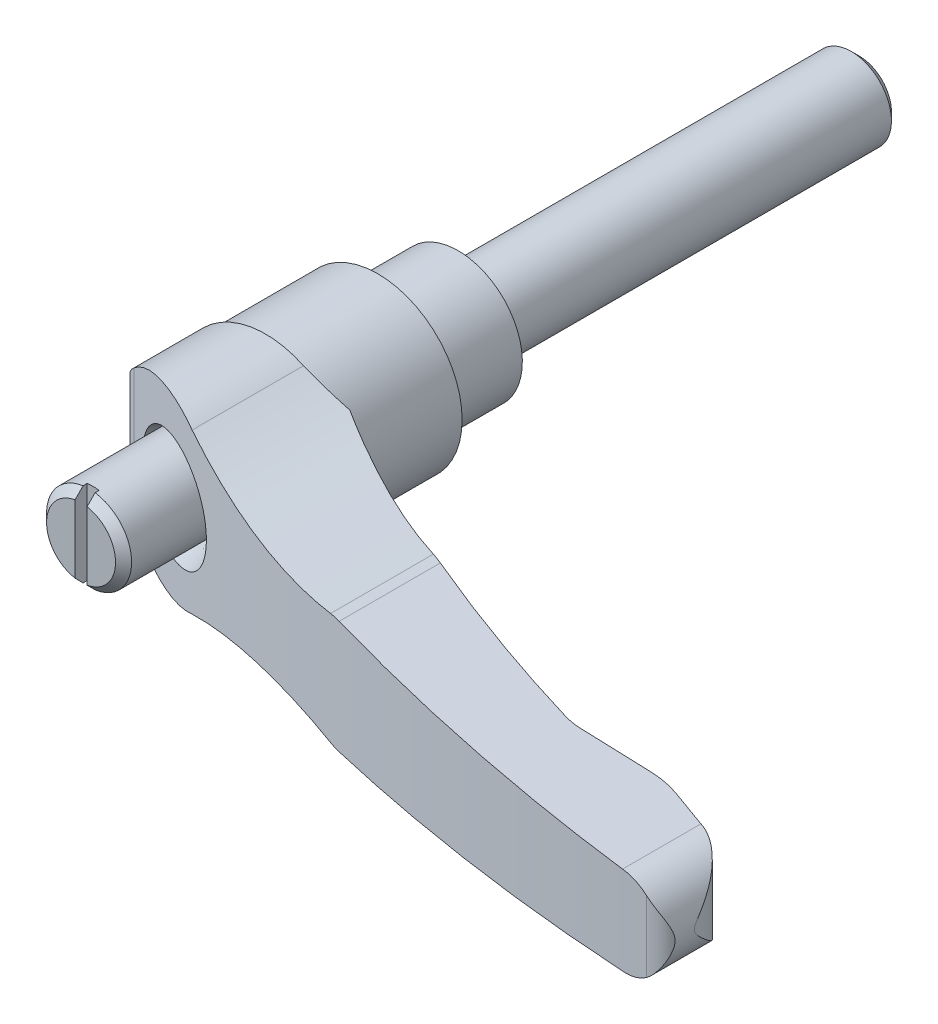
ISO-10303-21;
HEADER;
FILE_DESCRIPTION(('STEP AP214'),'2;1');
FILE_NAME('part.step','',(''),(''),'','','');
FILE_SCHEMA(('AUTOMOTIVE_DESIGN { 1 0 10303 214 1 1 1 1 }'));
ENDSEC;
DATA;
#1=APPLICATION_CONTEXT('core data for automotive mechanical design processes');
#2=APPLICATION_PROTOCOL_DEFINITION('international standard','automotive_design',2000,#1);
#3=PRODUCT_CONTEXT('',#1,'mechanical');
#4=PRODUCT('Part','Part','',(#3));
#5=PRODUCT_RELATED_PRODUCT_CATEGORY('part','',(#4));
#6=PRODUCT_DEFINITION_FORMATION('','',#4);
#7=PRODUCT_DEFINITION_CONTEXT('part definition',#1,'design');
#8=PRODUCT_DEFINITION('design','',#6,#7);
#9=PRODUCT_DEFINITION_SHAPE('','',#8);
#10=(LENGTH_UNIT() NAMED_UNIT(*) SI_UNIT(.MILLI.,.METRE.));
#11=(NAMED_UNIT(*) PLANE_ANGLE_UNIT() SI_UNIT($,.RADIAN.));
#12=(NAMED_UNIT(*) SI_UNIT($,.STERADIAN.) SOLID_ANGLE_UNIT());
#13=UNCERTAINTY_MEASURE_WITH_UNIT(LENGTH_MEASURE(1.E-05),#10,'distance_accuracy_value','');
#14=(GEOMETRIC_REPRESENTATION_CONTEXT(3) GLOBAL_UNCERTAINTY_ASSIGNED_CONTEXT((#13)) GLOBAL_UNIT_ASSIGNED_CONTEXT((#10,
#11,#12)) REPRESENTATION_CONTEXT('',''));
#15=CARTESIAN_POINT('',(0.,0.,0.));
#16=DIRECTION('',(0.,0.,1.));
#17=DIRECTION('',(1.,0.,0.));
#18=AXIS2_PLACEMENT_3D('',#15,#16,#17);
#19=CARTESIAN_POINT('',(-0.010000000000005,0.,27.8125));
#20=DIRECTION('',(0.,0.,-1.));
#21=DIRECTION('',(1.,0.,0.));
#22=AXIS2_PLACEMENT_3D('',#19,#20,#21);
#23=CYLINDRICAL_SURFACE('',#22,10.5);
#24=CARTESIAN_POINT('',(-0.0100000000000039,0.,24.));
#25=DIRECTION('',(0.,0.,1.));
#26=DIRECTION('',(0.,-1.,0.));
#27=AXIS2_PLACEMENT_3D('',#24,#25,#26);
#28=CIRCLE('',#27,10.5);
#29=CARTESIAN_POINT('',(-10.51,0.,24.));
#30=VERTEX_POINT('',#29);
#31=CARTESIAN_POINT('',(10.49,0.,24.));
#32=VERTEX_POINT('',#31);
#33=EDGE_CURVE('E571',#30,#32,#28,.T.);
#34=ORIENTED_EDGE('',*,*,#33,.F.);
#35=EDGE_CURVE('E575',#32,#30,#28,.T.);
#36=ORIENTED_EDGE('',*,*,#35,.F.);
#37=EDGE_LOOP('',(#34,#36));
#38=FACE_BOUND('',#37,.T.);
#39=CARTESIAN_POINT('',(-0.00999999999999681,0.,-0.250037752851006));
#40=DIRECTION('',(0.707106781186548,0.,0.707106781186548));
#41=DIRECTION('',(0.707106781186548,0.,-0.707106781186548));
#42=AXIS2_PLACEMENT_3D('',#39,#40,#41);
#43=ELLIPSE('',#42,14.8492424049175,10.5);
#44=CARTESIAN_POINT('',(-10.260037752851,-2.27743848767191,10.));
#45=VERTEX_POINT('',#44);
#46=CARTESIAN_POINT('',(-10.260037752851,2.27743848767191,10.));
#47=VERTEX_POINT('',#46);
#48=EDGE_CURVE('E294',#45,#47,#43,.F.);
#49=ORIENTED_EDGE('',*,*,#48,.F.);
#50=CARTESIAN_POINT('',(-0.0099999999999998,0.,10.));
#51=DIRECTION('',(0.,0.,-1.));
#52=DIRECTION('',(1.,0.,0.));
#53=AXIS2_PLACEMENT_3D('',#50,#51,#52);
#54=CIRCLE('',#53,10.5);
#55=EDGE_CURVE('E176',#47,#45,#54,.T.);
#56=ORIENTED_EDGE('',*,*,#55,.F.);
#57=EDGE_LOOP('',(#49,#56));
#58=FACE_BOUND('',#57,.T.);
#59=ADVANCED_FACE('F14',(#38,#58),#23,.T.);
#60=CARTESIAN_POINT('',(57.3760512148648,-12.,33.4699999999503));
#61=DIRECTION('',(0.,1.,0.));
#62=DIRECTION('',(-1.,0.,0.));
#63=AXIS2_PLACEMENT_3D('',#60,#61,#62);
#64=CYLINDRICAL_SURFACE('',#63,8.59000000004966);
#65=CARTESIAN_POINT('',(57.3760512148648,6.11892873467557,33.4699999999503));
#66=DIRECTION('',(0.0361204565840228,0.999347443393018,0.));
#67=DIRECTION('',(-0.999347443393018,0.0361204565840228,0.));
#68=AXIS2_PLACEMENT_3D('',#65,#66,#67);
#69=ELLIPSE('',#68,8.59560912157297,8.59000000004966);
#70=CARTESIAN_POINT('',(57.37605121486,6.11892873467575,42.06));
#71=VERTEX_POINT('',#70);
#72=CARTESIAN_POINT('',(55.1138126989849,6.20069518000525,41.7567591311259));
#73=VERTEX_POINT('',#72);
#74=EDGE_CURVE('E1126',#71,#73,#69,.F.);
#75=ORIENTED_EDGE('',*,*,#74,.F.);
#76=DIRECTION('',(0.,1.,0.));
#77=VECTOR('',#76,1.);
#78=CARTESIAN_POINT('',(57.37605121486,-12.,42.06));
#79=LINE('',#78,#77);
#80=CARTESIAN_POINT('',(57.37605121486,-6.11892873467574,42.06));
#81=VERTEX_POINT('',#80);
#82=EDGE_CURVE('E598',#81,#71,#79,.T.);
#83=ORIENTED_EDGE('',*,*,#82,.F.);
#84=CARTESIAN_POINT('',(57.3760512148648,-6.11892873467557,33.4699999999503));
#85=DIRECTION('',(0.0361204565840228,-0.999347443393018,0.));
#86=DIRECTION('',(0.999347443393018,0.0361204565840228,0.));
#87=AXIS2_PLACEMENT_3D('',#84,#85,#86);
#88=ELLIPSE('',#87,8.59560912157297,8.59000000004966);
#89=CARTESIAN_POINT('',(55.1138126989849,-6.20069518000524,41.7567591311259));
#90=VERTEX_POINT('',#89);
#91=EDGE_CURVE('E1119',#90,#81,#88,.F.);
#92=ORIENTED_EDGE('',*,*,#91,.F.);
#93=DIRECTION('',(0.,1.,0.));
#94=VECTOR('',#93,1.);
#95=CARTESIAN_POINT('',(55.1138126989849,-12.,41.7567591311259));
#96=LINE('',#95,#94);
#97=EDGE_CURVE('E601',#90,#73,#96,.T.);
#98=ORIENTED_EDGE('',*,*,#97,.T.);
#99=EDGE_LOOP('',(#75,#83,#92,#98));
#100=FACE_BOUND('',#99,.T.);
#101=ADVANCED_FACE('F384',(#100),#64,.F.);
#102=CARTESIAN_POINT('',(57.37605121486,-12.,42.06));
#103=DIRECTION('',(0.,0.,1.));
#104=DIRECTION('',(0.,-1.,0.));
#105=AXIS2_PLACEMENT_3D('',#102,#103,#104);
#106=PLANE('',#105);
#107=DIRECTION('',(-0.999347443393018,0.0361204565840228,0.));
#108=VECTOR('',#107,1.);
#109=CARTESIAN_POINT('',(58.0300881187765,6.09528919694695,42.06));
#110=LINE('',#109,#108);
#111=CARTESIAN_POINT('',(66.163324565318,5.80132115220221,42.06));
#112=VERTEX_POINT('',#111);
#113=EDGE_CURVE('E1127',#112,#71,#110,.T.);
#114=ORIENTED_EDGE('',*,*,#113,.F.);
#115=DIRECTION('',(0.,1.,0.));
#116=VECTOR('',#115,1.);
#117=CARTESIAN_POINT('',(66.163324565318,-12.,42.06));
#118=LINE('',#117,#116);
#119=CARTESIAN_POINT('',(66.163324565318,-5.80132115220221,42.06));
#120=VERTEX_POINT('',#119);
#121=EDGE_CURVE('E595',#120,#112,#118,.T.);
#122=ORIENTED_EDGE('',*,*,#121,.F.);
#123=DIRECTION('',(0.999347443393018,0.0361204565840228,0.));
#124=VECTOR('',#123,1.);
#125=CARTESIAN_POINT('',(57.1637628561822,-6.12660169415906,42.06));
#126=LINE('',#125,#124);
#127=EDGE_CURVE('E1124',#81,#120,#126,.T.);
#128=ORIENTED_EDGE('',*,*,#127,.F.);
#129=ORIENTED_EDGE('',*,*,#82,.T.);
#130=EDGE_LOOP('',(#114,#122,#128,#129));
#131=FACE_BOUND('',#130,.T.);
#132=ADVANCED_FACE('F523',(#131),#106,.F.);
#133=CARTESIAN_POINT('',(66.1633245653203,-12.,53.3399999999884));
#134=DIRECTION('',(0.,1.,0.));
#135=DIRECTION('',(-1.,0.,0.));
#136=AXIS2_PLACEMENT_3D('',#133,#134,#135);
#137=CYLINDRICAL_SURFACE('',#136,11.2799999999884);
#138=CARTESIAN_POINT('',(66.1633245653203,5.80132115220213,53.3399999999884));
#139=DIRECTION('',(0.0361204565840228,0.999347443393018,0.));
#140=DIRECTION('',(-0.999347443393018,0.0361204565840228,0.));
#141=AXIS2_PLACEMENT_3D('',#138,#139,#140);
#142=ELLIPSE('',#141,11.2873656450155,11.2799999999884);
#143=CARTESIAN_POINT('',(69.761185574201,5.6712799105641,42.649172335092));
#144=VERTEX_POINT('',#143);
#145=EDGE_CURVE('E1128',#144,#112,#142,.T.);
#146=ORIENTED_EDGE('',*,*,#145,.F.);
#147=DIRECTION('',(0.,1.,0.));
#148=VECTOR('',#147,1.);
#149=CARTESIAN_POINT('',(69.761185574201,-12.,42.649172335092));
#150=LINE('',#149,#148);
#151=CARTESIAN_POINT('',(69.761185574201,-5.6712799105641,42.649172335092));
#152=VERTEX_POINT('',#151);
#153=EDGE_CURVE('E592',#152,#144,#150,.T.);
#154=ORIENTED_EDGE('',*,*,#153,.F.);
#155=CARTESIAN_POINT('',(66.1633245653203,-5.80132115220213,53.3399999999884));
#156=DIRECTION('',(0.0361204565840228,-0.999347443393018,0.));
#157=DIRECTION('',(0.999347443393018,0.0361204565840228,0.));
#158=AXIS2_PLACEMENT_3D('',#155,#156,#157);
#159=ELLIPSE('',#158,11.2873656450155,11.2799999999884);
#160=EDGE_CURVE('E1149',#120,#152,#159,.T.);
#161=ORIENTED_EDGE('',*,*,#160,.F.);
#162=ORIENTED_EDGE('',*,*,#121,.T.);
#163=EDGE_LOOP('',(#146,#154,#161,#162));
#164=FACE_BOUND('',#163,.T.);
#165=ADVANCED_FACE('F424',(#164),#137,.T.);
#166=CARTESIAN_POINT('',(111.590768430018,-12.,-165.122809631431));
#167=DIRECTION('',(0.,1.,0.));
#168=DIRECTION('',(-1.,0.,0.));
#169=AXIS2_PLACEMENT_3D('',#166,#167,#168);
#170=CYLINDRICAL_SURFACE('',#169,214.450000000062);
#171=CARTESIAN_POINT('',(30.179428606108,-6.9666323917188,33.2732494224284));
#172=CARTESIAN_POINT('',(30.4222007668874,-7.0028281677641,33.3728739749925));
#173=CARTESIAN_POINT('',(30.6665043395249,-7.02781937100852,33.472598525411));
#174=CARTESIAN_POINT('',(31.033921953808,-7.04840105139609,33.6217860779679));
#175=CARTESIAN_POINT('',(31.1565128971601,-7.05244559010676,33.6714318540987));
#176=CARTESIAN_POINT('',(31.4020580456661,-7.05489552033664,33.7706062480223));
#177=CARTESIAN_POINT('',(31.5250125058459,-7.05329063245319,33.820134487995));
#178=CARTESIAN_POINT('',(31.647932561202,-7.0488469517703,33.8695155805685));
#179=B_SPLINE_CURVE_WITH_KNOTS('',3,(#171,#172,#173,#174,#175,#176,#177,#178),.UNSPECIFIED.,.F.,
.F.,(4,2,2,4),(0.,0.794258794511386,1.19111760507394,1.58869889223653),.UNSPECIFIED.);
#180=CARTESIAN_POINT('',(30.179428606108,-6.9666323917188,33.2732494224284));
#181=VERTEX_POINT('',#180);
#182=CARTESIAN_POINT('',(31.647932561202,-7.0488469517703,33.8695155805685));
#183=VERTEX_POINT('',#182);
#184=EDGE_CURVE('E440',#181,#183,#179,.T.);
#185=ORIENTED_EDGE('',*,*,#184,.F.);
#186=CARTESIAN_POINT('',(10.49,-8.03465812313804,24.));
#187=CARTESIAN_POINT('',(11.2781269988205,-7.82806345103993,24.4213315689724));
#188=CARTESIAN_POINT('',(12.0728488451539,-7.64070973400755,24.8398212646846));
#189=CARTESIAN_POINT('',(13.6740672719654,-7.30530099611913,25.6700985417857));
#190=CARTESIAN_POINT('',(14.4805646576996,-7.15724867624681,26.0818856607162));
#191=CARTESIAN_POINT('',(16.0966341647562,-6.90241973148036,26.8940746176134));
#192=CARTESIAN_POINT('',(16.906116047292,-6.79528972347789,27.2945449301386));
#193=CARTESIAN_POINT('',(18.5335723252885,-6.62127786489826,28.0868684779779));
#194=CARTESIAN_POINT('',(19.3515465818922,-6.55439535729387,28.4787218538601));
#195=CARTESIAN_POINT('',(20.9944633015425,-6.46166065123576,29.2529521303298));
#196=CARTESIAN_POINT('',(21.8194069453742,-6.43581555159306,29.6353273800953));
#197=CARTESIAN_POINT('',(23.474294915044,-6.42593469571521,30.3896366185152));
#198=CARTESIAN_POINT('',(24.3042391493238,-6.44189817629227,30.7615707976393));
#199=CARTESIAN_POINT('',(25.974600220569,-6.51667337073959,31.497417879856));
#200=CARTESIAN_POINT('',(26.8150445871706,-6.57586454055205,31.8612301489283));
#201=CARTESIAN_POINT('',(28.4970001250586,-6.7381558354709,32.5766232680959));
#202=CARTESIAN_POINT('',(29.3385114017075,-6.84126069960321,32.9282027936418));
#203=CARTESIAN_POINT('',(30.179428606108,-6.96663239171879,33.2732494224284));
#204=B_SPLINE_CURVE_WITH_KNOTS('',3,(#186,#187,#188,#189,#190,#191,#192,#193,#194,#195,#196,
#197,#198,#199,#200,#201,#202,#203),.UNSPECIFIED.,.F.,.F.,(4,2,2,2,2,2,2,2,4),(0.,
2.7515590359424,5.50330712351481,8.23072437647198,10.9580971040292,13.6859415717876,
16.4137362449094,19.1657679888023,21.9180967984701),.UNSPECIFIED.);
#205=CARTESIAN_POINT('',(10.49,-8.03465812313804,24.));
#206=VERTEX_POINT('',#205);
#207=EDGE_CURVE('E431',#206,#181,#204,.T.);
#208=ORIENTED_EDGE('',*,*,#207,.F.);
#209=DIRECTION('',(0.,1.,0.));
#210=VECTOR('',#209,1.);
#211=CARTESIAN_POINT('',(10.49,-12.,24.));
#212=LINE('',#211,#210);
#213=EDGE_CURVE('E605',#206,#32,#212,.T.);
#214=ORIENTED_EDGE('',*,*,#213,.T.);
#215=CARTESIAN_POINT('',(10.49,8.03465812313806,24.));
#216=VERTEX_POINT('',#215);
#217=EDGE_CURVE('E604',#32,#216,#212,.T.);
#218=ORIENTED_EDGE('',*,*,#217,.T.);
#219=CARTESIAN_POINT('',(30.179428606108,6.9666323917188,33.2732494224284));
#220=CARTESIAN_POINT('',(29.3385114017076,6.84126069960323,32.9282027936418));
#221=CARTESIAN_POINT('',(28.4970001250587,6.73815583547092,32.5766232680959));
#222=CARTESIAN_POINT('',(26.8150445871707,6.57586454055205,31.8612301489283));
#223=CARTESIAN_POINT('',(25.974600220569,6.51667337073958,31.497417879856));
#224=CARTESIAN_POINT('',(24.3042391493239,6.44189817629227,30.7615707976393));
#225=CARTESIAN_POINT('',(23.4742949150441,6.42593469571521,30.3896366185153));
#226=CARTESIAN_POINT('',(21.8194069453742,6.43581555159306,29.6353273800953));
#227=CARTESIAN_POINT('',(20.9944633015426,6.46166065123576,29.2529521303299));
#228=CARTESIAN_POINT('',(19.3515465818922,6.55439535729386,28.4787218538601));
#229=CARTESIAN_POINT('',(18.5335723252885,6.62127786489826,28.0868684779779));
#230=CARTESIAN_POINT('',(16.906116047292,6.79528972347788,27.2945449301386));
#231=CARTESIAN_POINT('',(16.0966341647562,6.90241973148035,26.8940746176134));
#232=CARTESIAN_POINT('',(14.4805646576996,7.15724867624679,26.0818856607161));
#233=CARTESIAN_POINT('',(13.6740672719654,7.30530099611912,25.6700985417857));
#234=CARTESIAN_POINT('',(12.0728488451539,7.64070973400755,24.8398212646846));
#235=CARTESIAN_POINT('',(11.2781269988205,7.82806345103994,24.4213315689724));
#236=CARTESIAN_POINT('',(10.49,8.03465812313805,24.));
#237=B_SPLINE_CURVE_WITH_KNOTS('',3,(#219,#220,#221,#222,#223,#224,#225,#226,#227,#228,#229,
#230,#231,#232,#233,#234,#235,#236),.UNSPECIFIED.,.F.,.F.,(4,2,2,2,2,2,2,2,4),(0.,
2.75232880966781,5.50436055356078,8.23215522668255,10.9599996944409,13.6873724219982,
16.4147896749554,19.1665377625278,21.9180967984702),.UNSPECIFIED.);
#238=CARTESIAN_POINT('',(30.179428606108,6.9666323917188,33.2732494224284));
#239=VERTEX_POINT('',#238);
#240=EDGE_CURVE('E411',#239,#216,#237,.T.);
#241=ORIENTED_EDGE('',*,*,#240,.F.);
#242=CARTESIAN_POINT('',(31.647932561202,7.0488469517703,33.8695155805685));
#243=CARTESIAN_POINT('',(31.5250125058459,7.05329063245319,33.820134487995));
#244=CARTESIAN_POINT('',(31.4020580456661,7.05489552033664,33.7706062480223));
#245=CARTESIAN_POINT('',(31.1565128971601,7.05244559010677,33.6714318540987));
#246=CARTESIAN_POINT('',(31.033921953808,7.04840105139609,33.6217860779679));
#247=CARTESIAN_POINT('',(30.666504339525,7.02781937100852,33.472598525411));
#248=CARTESIAN_POINT('',(30.4222007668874,7.0028281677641,33.3728739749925));
#249=CARTESIAN_POINT('',(30.179428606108,6.9666323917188,33.2732494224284));
#250=B_SPLINE_CURVE_WITH_KNOTS('',3,(#242,#243,#244,#245,#246,#247,#248,#249),.UNSPECIFIED.,.F.,
.F.,(4,2,2,4),(0.,0.39758128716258,0.794440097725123,1.58869889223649),.UNSPECIFIED.);
#251=CARTESIAN_POINT('',(31.647932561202,7.0488469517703,33.8695155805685));
#252=VERTEX_POINT('',#251);
#253=EDGE_CURVE('E403',#252,#239,#250,.T.);
#254=ORIENTED_EDGE('',*,*,#253,.F.);
#255=CARTESIAN_POINT('',(111.590768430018,4.15938968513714,-165.122809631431));
#256=DIRECTION('',(0.0361204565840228,0.999347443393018,0.));
#257=DIRECTION('',(-0.999347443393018,0.0361204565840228,0.));
#258=AXIS2_PLACEMENT_3D('',#255,#256,#257);
#259=ELLIPSE('',#258,214.590032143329,214.450000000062);
#260=EDGE_CURVE('E412',#73,#252,#259,.F.);
#261=ORIENTED_EDGE('',*,*,#260,.F.);
#262=ORIENTED_EDGE('',*,*,#97,.F.);
#263=CARTESIAN_POINT('',(111.590768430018,-4.15938968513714,-165.122809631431));
#264=DIRECTION('',(0.0361204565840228,-0.999347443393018,0.));
#265=DIRECTION('',(0.999347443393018,0.0361204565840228,0.));
#266=AXIS2_PLACEMENT_3D('',#263,#264,#265);
#267=ELLIPSE('',#266,214.590032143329,214.450000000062);
#268=EDGE_CURVE('E1117',#183,#90,#267,.F.);
#269=ORIENTED_EDGE('',*,*,#268,.F.);
#270=EDGE_LOOP('',(#185,#208,#214,#218,#241,#254,#261,#262,#269));
#271=FACE_BOUND('',#270,.T.);
#272=ADVANCED_FACE('F419',(#271),#170,.F.);
#273=CARTESIAN_POINT('',(79.996705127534,-12.,50.539592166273));
#274=DIRECTION('',(-0.99233193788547,0.,0.123601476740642));
#275=DIRECTION('',(-0.123601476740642,0.,-0.99233193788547));
#276=AXIS2_PLACEMENT_3D('',#273,#274,#275);
#277=PLANE('',#276);
#278=CARTESIAN_POINT('',(74.5,0.,6.40940703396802));
#279=DIRECTION('',(-0.99233193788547,0.,0.123601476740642));
#280=DIRECTION('',(0.123601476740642,0.,0.99233193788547));
#281=AXIS2_PLACEMENT_3D('',#278,#279,#280);
#282=ELLIPSE('',#281,44.4978502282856,5.5);
#283=CARTESIAN_POINT('',(79.996705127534,-0.190348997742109,50.539592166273));
#284=VERTEX_POINT('',#283);
#285=CARTESIAN_POINT('',(79.996705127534,0.190348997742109,50.539592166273));
#286=VERTEX_POINT('',#285);
#287=EDGE_CURVE('E505',#284,#286,#282,.T.);
#288=ORIENTED_EDGE('',*,*,#287,.F.);
#289=DIRECTION('',(0.,1.,0.));
#290=VECTOR('',#289,1.);
#291=CARTESIAN_POINT('',(79.996705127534,-12.,50.539592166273));
#292=LINE('',#291,#290);
#293=EDGE_CURVE('E586',#284,#286,#292,.T.);
#294=ORIENTED_EDGE('',*,*,#293,.T.);
#295=EDGE_LOOP('',(#288,#294));
#296=FACE_BOUND('',#295,.T.);
#297=ADVANCED_FACE('F423',(#296),#277,.F.);
#298=CARTESIAN_POINT('',(72.6137555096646,-12.,51.4591871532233));
#299=DIRECTION('',(0.,1.,0.));
#300=DIRECTION('',(-1.,0.,0.));
#301=AXIS2_PLACEMENT_3D('',#298,#299,#300);
#302=CYLINDRICAL_SURFACE('',#301,7.44000000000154);
#303=CARTESIAN_POINT('',(74.986812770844,-5.47841339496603,44.407790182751));
#304=CARTESIAN_POINT('',(75.1398120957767,-5.4648402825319,44.4592429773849));
#305=CARTESIAN_POINT('',(75.2905169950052,-5.44496899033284,44.5155387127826));
#306=CARTESIAN_POINT('',(75.5860882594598,-5.39377415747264,44.6368581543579));
#307=CARTESIAN_POINT('',(75.730963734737,-5.36246932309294,44.7018674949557));
#308=CARTESIAN_POINT('',(76.0125967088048,-5.2898955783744,44.839081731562));
#309=CARTESIAN_POINT('',(76.149425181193,-5.248738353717,44.9112009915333));
#310=CARTESIAN_POINT('',(76.4161065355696,-5.1573648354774,45.062373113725));
#311=CARTESIAN_POINT('',(76.5459558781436,-5.10714400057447,45.1414294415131));
#312=CARTESIAN_POINT('',(76.827653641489,-4.98604991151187,45.3247681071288));
#313=CARTESIAN_POINT('',(76.9775772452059,-4.91309116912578,45.4306358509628));
#314=CARTESIAN_POINT('',(77.2657899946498,-4.75681575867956,45.6501400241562));
#315=CARTESIAN_POINT('',(77.4040776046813,-4.67349772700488,45.7637774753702));
#316=CARTESIAN_POINT('',(77.8028296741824,-4.40945601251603,46.1156758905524));
#317=CARTESIAN_POINT('',(78.0457801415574,-4.21527563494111,46.3639882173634));
#318=CARTESIAN_POINT('',(78.4176945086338,-3.86589184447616,46.7984433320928));
#319=CARTESIAN_POINT('',(78.558647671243,-3.71726415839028,46.9799982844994));
#320=CARTESIAN_POINT('',(78.8199419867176,-3.41009407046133,47.3496806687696));
#321=CARTESIAN_POINT('',(78.9402736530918,-3.25154715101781,47.5378110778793));
#322=CARTESIAN_POINT('',(79.1607378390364,-2.92676895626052,47.9181651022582));
#323=CARTESIAN_POINT('',(79.2609186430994,-2.76055725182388,48.1103776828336));
#324=CARTESIAN_POINT('',(79.4421677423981,-2.42115236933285,48.497428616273));
#325=CARTESIAN_POINT('',(79.5232445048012,-2.24796232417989,48.6922657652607));
#326=CARTESIAN_POINT('',(79.657896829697,-1.91676087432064,49.0578102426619));
#327=CARTESIAN_POINT('',(79.713648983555,-1.75958096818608,49.2284695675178));
#328=CARTESIAN_POINT('',(79.7869638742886,-1.51825146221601,49.4826945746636));
#329=CARTESIAN_POINT('',(79.8097141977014,-1.43673320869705,49.5672896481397));
#330=CARTESIAN_POINT('',(79.8517302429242,-1.27132927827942,49.7350141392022));
#331=CARTESIAN_POINT('',(79.8709966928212,-1.18744410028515,49.8181438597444));
#332=CARTESIAN_POINT('',(79.907186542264,-1.01046435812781,49.986973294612));
#333=CARTESIAN_POINT('',(79.9238666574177,-0.917129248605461,50.0724723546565));
#334=CARTESIAN_POINT('',(79.9529450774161,-0.724505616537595,50.2358460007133));
#335=CARTESIAN_POINT('',(79.9653823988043,-0.625281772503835,50.3137850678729));
#336=CARTESIAN_POINT('',(79.9802376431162,-0.46858024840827,50.4153149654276));
#337=CARTESIAN_POINT('',(79.9845030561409,-0.416215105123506,50.4460963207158));
#338=CARTESIAN_POINT('',(79.9917045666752,-0.306879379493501,50.4998809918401));
#339=CARTESIAN_POINT('',(79.9946243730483,-0.249861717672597,50.522788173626));
#340=CARTESIAN_POINT('',(79.996705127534,-0.190348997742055,50.539592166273));
#341=B_SPLINE_CURVE_WITH_KNOTS('',3,(#303,#304,#305,#306,#307,#308,#309,#310,#311,#312,#313,
#314,#315,#316,#317,#318,#319,#320,#321,#322,#323,#324,#325,#326,#327,#328,#329,#330,#331,#332,
#333,#334,#335,#336,#337,#338,#339,#340),.UNSPECIFIED.,.F.,.F.,(4,2,2,2,2,2,2,2,2,2,2,2,2,2,2,2,
2,2,4),(0.,0.485611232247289,0.970431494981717,1.44999646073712,1.92980238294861,
2.52141817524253,3.11311192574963,4.30183389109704,5.12208341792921,5.94270927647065,
6.76134473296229,7.57961667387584,8.29494630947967,8.65387747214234,9.01273353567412,
9.39561932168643,9.77488268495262,9.95698827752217,10.1412441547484),.UNSPECIFIED.);
#342=CARTESIAN_POINT('',(74.986812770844,-5.47841339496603,44.407790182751));
#343=VERTEX_POINT('',#342);
#344=EDGE_CURVE('E504',#343,#284,#341,.T.);
#345=ORIENTED_EDGE('',*,*,#344,.F.);
#346=DIRECTION('',(0.,1.,0.));
#347=VECTOR('',#346,1.);
#348=CARTESIAN_POINT('',(74.986812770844,-12.,44.407790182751));
#349=LINE('',#348,#347);
#350=CARTESIAN_POINT('',(74.986812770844,5.47841339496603,44.407790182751));
#351=VERTEX_POINT('',#350);
#352=EDGE_CURVE('E589',#343,#351,#349,.T.);
#353=ORIENTED_EDGE('',*,*,#352,.T.);
#354=CARTESIAN_POINT('',(79.996705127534,0.190348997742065,50.539592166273));
#355=CARTESIAN_POINT('',(79.9951469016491,0.235214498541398,50.5270575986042));
#356=CARTESIAN_POINT('',(79.9930953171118,0.278736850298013,50.5108629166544));
#357=CARTESIAN_POINT('',(79.9881648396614,0.363077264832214,50.47327081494));
#358=CARTESIAN_POINT('',(79.9852922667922,0.403913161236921,50.451913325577));
#359=CARTESIAN_POINT('',(79.9757020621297,0.522458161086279,50.3833482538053));
#360=CARTESIAN_POINT('',(79.9679715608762,0.597169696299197,50.3312876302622));
#361=CARTESIAN_POINT('',(79.950886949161,0.736456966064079,50.225155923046));
#362=CARTESIAN_POINT('',(79.9416856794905,0.801375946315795,50.1714851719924));
#363=CARTESIAN_POINT('',(79.9214540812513,0.928420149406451,50.0612288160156));
#364=CARTESIAN_POINT('',(79.9104232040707,0.990544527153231,50.0046423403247));
#365=CARTESIAN_POINT('',(79.8746515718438,1.17419942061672,49.832312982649));
#366=CARTESIAN_POINT('',(79.847248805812,1.29287988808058,49.7141099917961));
#367=CARTESIAN_POINT('',(79.7848398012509,1.52823594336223,49.4729704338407));
#368=CARTESIAN_POINT('',(79.749692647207,1.64482416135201,49.3499864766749));
#369=CARTESIAN_POINT('',(79.6721004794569,1.8745831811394,49.1033284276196));
#370=CARTESIAN_POINT('',(79.6296610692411,1.98775652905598,48.9796549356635));
#371=CARTESIAN_POINT('',(79.5033816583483,2.29352791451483,48.641550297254));
#372=CARTESIAN_POINT('',(79.4120558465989,2.48329449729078,48.4272966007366));
#373=CARTESIAN_POINT('',(79.2061355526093,2.85434488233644,48.0023120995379));
#374=CARTESIAN_POINT('',(79.0915236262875,3.03562219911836,47.791584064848));
#375=CARTESIAN_POINT('',(78.8390032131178,3.38665877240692,47.3777391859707));
#376=CARTESIAN_POINT('',(78.7012752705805,3.5564939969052,47.174577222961));
#377=CARTESIAN_POINT('',(78.4009143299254,3.88356808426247,46.7768350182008));
#378=CARTESIAN_POINT('',(78.2383021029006,4.04081728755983,46.5822477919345));
#379=CARTESIAN_POINT('',(77.9568022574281,4.28016983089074,46.2794503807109));
#380=CARTESIAN_POINT('',(77.8461272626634,4.36735584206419,46.1675710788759));
#381=CARTESIAN_POINT('',(77.615129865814,4.53501217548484,45.9487274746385));
#382=CARTESIAN_POINT('',(77.4948054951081,4.61548112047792,45.8417641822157));
#383=CARTESIAN_POINT('',(77.2447591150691,4.76840923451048,45.633916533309));
#384=CARTESIAN_POINT('',(77.1150589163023,4.84088606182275,45.5330190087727));
#385=CARTESIAN_POINT('',(76.846172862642,4.97676025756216,45.3380932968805));
#386=CARTESIAN_POINT('',(76.7069926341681,5.04016294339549,45.2440611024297));
#387=CARTESIAN_POINT('',(76.4438690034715,5.14664435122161,45.079244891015));
#388=CARTESIAN_POINT('',(76.3213555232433,5.19134589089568,45.0072256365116));
#389=CARTESIAN_POINT('',(76.0703754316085,5.27269544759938,44.8693561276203));
#390=CARTESIAN_POINT('',(75.9419112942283,5.30934677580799,44.803503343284));
#391=CARTESIAN_POINT('',(75.6784961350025,5.3739797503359,44.6781572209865));
#392=CARTESIAN_POINT('',(75.5435027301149,5.40189236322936,44.618716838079));
#393=CARTESIAN_POINT('',(75.268600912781,5.44782102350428,44.5073869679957));
#394=CARTESIAN_POINT('',(75.1286862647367,5.46582399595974,44.4555075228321));
#395=CARTESIAN_POINT('',(74.986812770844,5.47841339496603,44.407790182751));
#396=B_SPLINE_CURVE_WITH_KNOTS('',3,(#354,#355,#356,#357,#358,#359,#360,#361,#362,#363,#364,
#365,#366,#367,#368,#369,#370,#371,#372,#373,#374,#375,#376,#377,#378,#379,#380,#381,#382,#383,
#384,#385,#386,#387,#388,#389,#390,#391,#392,#393,#394,#395),.UNSPECIFIED.,.F.,.F.,(4,2,2,2,2,2,
2,2,2,2,2,2,2,2,2,2,2,2,2,2,4),(0.,0.139245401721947,0.277446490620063,0.550810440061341,
0.804906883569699,1.05907965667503,1.56794086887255,2.08696422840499,2.60559053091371,
3.50582150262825,4.4067293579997,5.30090298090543,6.19433426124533,6.73367946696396,
7.27313498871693,7.81137365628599,8.34929561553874,8.7958064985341,9.24213337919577,
9.69190199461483,10.1422626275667),.UNSPECIFIED.);
#397=EDGE_CURVE('E498',#286,#351,#396,.T.);
#398=ORIENTED_EDGE('',*,*,#397,.F.);
#399=ORIENTED_EDGE('',*,*,#293,.F.);
#400=EDGE_LOOP('',(#345,#353,#398,#399));
#401=FACE_BOUND('',#400,.T.);
#402=ADVANCED_FACE('F511',(#401),#302,.T.);
#403=CARTESIAN_POINT('',(69.761185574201,-12.,42.649172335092));
#404=DIRECTION('',(-0.318959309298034,0.,0.947768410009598));
#405=DIRECTION('',(-0.947768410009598,0.,-0.318959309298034));
#406=AXIS2_PLACEMENT_3D('',#403,#404,#405);
#407=PLANE('',#406);
#408=DIRECTION('',(-0.947212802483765,0.0342360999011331,-0.318772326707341));
#409=VECTOR('',#408,1.);
#410=CARTESIAN_POINT('',(70.3342452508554,5.65056721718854,42.8420282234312));
#411=LINE('',#410,#409);
#412=CARTESIAN_POINT('',(74.5,5.5,44.2439595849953));
#413=VERTEX_POINT('',#412);
#414=EDGE_CURVE('E1132',#413,#144,#411,.T.);
#415=ORIENTED_EDGE('',*,*,#414,.F.);
#416=CARTESIAN_POINT('',(74.5,0.,44.2439595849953));
#417=DIRECTION('',(-0.318959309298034,0.,0.947768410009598));
#418=DIRECTION('',(0.947768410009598,0.,0.318959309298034));
#419=AXIS2_PLACEMENT_3D('',#416,#417,#418);
#420=ELLIPSE('',#419,5.80310542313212,5.5);
#421=EDGE_CURVE('E1133',#351,#413,#420,.T.);
#422=ORIENTED_EDGE('',*,*,#421,.F.);
#423=ORIENTED_EDGE('',*,*,#352,.F.);
#424=CARTESIAN_POINT('',(74.5,-5.5,44.2439595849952));
#425=VERTEX_POINT('',#424);
#426=EDGE_CURVE('E1134',#425,#343,#420,.T.);
#427=ORIENTED_EDGE('',*,*,#426,.F.);
#428=DIRECTION('',(0.947212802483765,0.0342360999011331,0.318772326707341));
#429=VECTOR('',#428,1.);
#430=CARTESIAN_POINT('',(69.5559523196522,-5.6786978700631,42.5801037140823));
#431=LINE('',#430,#429);
#432=EDGE_CURVE('E446',#152,#425,#431,.T.);
#433=ORIENTED_EDGE('',*,*,#432,.F.);
#434=ORIENTED_EDGE('',*,*,#153,.T.);
#435=EDGE_LOOP('',(#415,#422,#423,#427,#433,#434));
#436=FACE_BOUND('',#435,.T.);
#437=ADVANCED_FACE('F516',(#436),#407,.F.);
#438=CARTESIAN_POINT('',(-10.51,-12.,24.));
#439=DIRECTION('',(0.,0.,1.));
#440=DIRECTION('',(0.,-1.,0.));
#441=AXIS2_PLACEMENT_3D('',#438,#439,#440);
#442=PLANE('',#441);
#443=CARTESIAN_POINT('',(22.94,55.5300000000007,24.));
#444=DIRECTION('',(0.,0.,1.));
#445=DIRECTION('',(0.,-1.,0.));
#446=AXIS2_PLACEMENT_3D('',#443,#444,#445);
#447=CIRCLE('',#446,49.1000000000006);
#448=CARTESIAN_POINT('',(4.7225102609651,9.9346815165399,24.));
#449=VERTEX_POINT('',#448);
#450=EDGE_CURVE('E572',#216,#449,#447,.F.);
#451=ORIENTED_EDGE('',*,*,#450,.F.);
#452=ORIENTED_EDGE('',*,*,#217,.F.);
#453=ORIENTED_EDGE('',*,*,#35,.T.);
#454=DIRECTION('',(0.,1.,0.));
#455=VECTOR('',#454,1.);
#456=CARTESIAN_POINT('',(-10.51,-12.,24.));
#457=LINE('',#456,#455);
#458=CARTESIAN_POINT('',(-10.51,3.24652121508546,24.));
#459=VERTEX_POINT('',#458);
#460=EDGE_CURVE('E606',#30,#459,#457,.T.);
#461=ORIENTED_EDGE('',*,*,#460,.T.);
#462=CARTESIAN_POINT('',(0.,0.,24.));
#463=DIRECTION('',(0.,0.,1.));
#464=DIRECTION('',(0.,-1.,0.));
#465=AXIS2_PLACEMENT_3D('',#462,#463,#464);
#466=CIRCLE('',#465,11.);
#467=EDGE_CURVE('E618',#449,#459,#466,.T.);
#468=ORIENTED_EDGE('',*,*,#467,.F.);
#469=EDGE_LOOP('',(#451,#452,#453,#461,#468));
#470=FACE_BOUND('',#469,.T.);
#471=ADVANCED_FACE('F427',(#470),#442,.F.);
#472=CARTESIAN_POINT('',(22.94,-55.5300000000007,24.));
#473=DIRECTION('',(0.,0.,1.));
#474=DIRECTION('',(0.,-1.,0.));
#475=AXIS2_PLACEMENT_3D('',#472,#473,#474);
#476=CIRCLE('',#475,49.1000000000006);
#477=CARTESIAN_POINT('',(4.7225102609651,-9.9346815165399,24.));
#478=VERTEX_POINT('',#477);
#479=EDGE_CURVE('E447',#478,#206,#476,.F.);
#480=ORIENTED_EDGE('',*,*,#479,.F.);
#481=CARTESIAN_POINT('',(0.,0.,24.));
#482=DIRECTION('',(0.,0.,1.));
#483=DIRECTION('',(0.,-1.,0.));
#484=AXIS2_PLACEMENT_3D('',#481,#482,#483);
#485=CIRCLE('',#484,11.);
#486=CARTESIAN_POINT('',(-10.51,-3.24652121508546,24.));
#487=VERTEX_POINT('',#486);
#488=EDGE_CURVE('E632',#487,#478,#485,.T.);
#489=ORIENTED_EDGE('',*,*,#488,.F.);
#490=EDGE_CURVE('E607',#487,#30,#457,.T.);
#491=ORIENTED_EDGE('',*,*,#490,.T.);
#492=ORIENTED_EDGE('',*,*,#33,.T.);
#493=ORIENTED_EDGE('',*,*,#213,.F.);
#494=EDGE_LOOP('',(#480,#489,#491,#492,#493));
#495=FACE_BOUND('',#494,.T.);
#496=ADVANCED_FACE('F642',(#495),#442,.F.);
#497=CARTESIAN_POINT('',(77.9746679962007,-12.,52.1048483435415));
#498=DIRECTION('',(0.,1.,0.));
#499=DIRECTION('',(-1.,0.,0.));
#500=AXIS2_PLACEMENT_3D('',#497,#498,#499);
#501=CYLINDRICAL_SURFACE('',#500,2.20000000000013);
#502=CARTESIAN_POINT('',(77.798742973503,4.40094248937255,54.297803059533));
#503=CARTESIAN_POINT('',(77.873929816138,4.34461033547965,54.3038288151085));
#504=CARTESIAN_POINT('',(77.9477917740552,4.28621521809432,54.3058709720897));
#505=CARTESIAN_POINT('',(78.0922208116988,4.16589830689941,54.3028912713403));
#506=CARTESIAN_POINT('',(78.1627937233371,4.10398322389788,54.2978824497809));
#507=CARTESIAN_POINT('',(78.2996338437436,3.97761161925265,54.2817956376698));
#508=CARTESIAN_POINT('',(78.3659353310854,3.91318450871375,54.2707752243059));
#509=CARTESIAN_POINT('',(78.4947211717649,3.78162408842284,54.2435114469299));
#510=CARTESIAN_POINT('',(78.5572032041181,3.71448917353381,54.2272649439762));
#511=CARTESIAN_POINT('',(78.7037263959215,3.54901721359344,54.182483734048));
#512=CARTESIAN_POINT('',(78.7857223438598,3.44948168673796,54.1516573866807));
#513=CARTESIAN_POINT('',(78.9414411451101,3.24653335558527,54.0828783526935));
#514=CARTESIAN_POINT('',(79.0151615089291,3.14311939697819,54.0449235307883));
#515=CARTESIAN_POINT('',(79.2246832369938,2.82692774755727,53.9224540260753));
#516=CARTESIAN_POINT('',(79.3481089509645,2.609042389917,53.829588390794));
#517=CARTESIAN_POINT('',(79.5118173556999,2.26904106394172,53.6805956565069));
#518=CARTESIAN_POINT('',(79.5637254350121,2.15065893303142,53.6280001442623));
#519=CARTESIAN_POINT('',(79.6590195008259,1.91080459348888,53.5218995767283));
#520=CARTESIAN_POINT('',(79.7024022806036,1.789331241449,53.4683941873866));
#521=CARTESIAN_POINT('',(79.7806945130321,1.54303752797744,53.3628544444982));
#522=CARTESIAN_POINT('',(79.8156035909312,1.41821701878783,53.3108201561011));
#523=CARTESIAN_POINT('',(79.8768533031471,1.16468164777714,53.2116769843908));
#524=CARTESIAN_POINT('',(79.9031999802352,1.03596960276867,53.1645646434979));
#525=CARTESIAN_POINT('',(79.9502292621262,0.753846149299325,53.0744438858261));
#526=CARTESIAN_POINT('',(79.9694918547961,0.599603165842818,53.0330810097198));
#527=CARTESIAN_POINT('',(79.9884623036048,0.364537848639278,52.9907827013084));
#528=CARTESIAN_POINT('',(79.993132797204,0.285927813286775,52.9799792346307));
#529=CARTESIAN_POINT('',(79.9990802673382,0.12789817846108,52.9661347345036));
#530=CARTESIAN_POINT('',(80.0003586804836,0.048478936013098,52.9630904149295));
#531=CARTESIAN_POINT('',(79.9994656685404,-0.110643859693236,52.965194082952));
#532=CARTESIAN_POINT('',(79.9972760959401,-0.190346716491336,52.9703851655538));
#533=CARTESIAN_POINT('',(79.9895067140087,-0.348729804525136,52.9883178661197));
#534=CARTESIAN_POINT('',(79.983925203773,-0.427409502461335,53.0010632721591));
#535=CARTESIAN_POINT('',(79.9622241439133,-0.662630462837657,53.0486779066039));
#536=CARTESIAN_POINT('',(79.9411622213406,-0.816788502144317,53.0928557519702));
#537=CARTESIAN_POINT('',(79.8883952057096,-1.11212828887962,53.1914221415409));
#538=CARTESIAN_POINT('',(79.85716938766,-1.25358307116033,53.245309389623));
#539=CARTESIAN_POINT('',(79.7842829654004,-1.53200335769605,53.3577691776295));
#540=CARTESIAN_POINT('',(79.74261300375,-1.66896471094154,53.4163458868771));
#541=CARTESIAN_POINT('',(79.6489027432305,-1.93886019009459,53.5340438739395));
#542=CARTESIAN_POINT('',(79.5968732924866,-2.07179836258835,53.5931645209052));
#543=CARTESIAN_POINT('',(79.4822877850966,-2.33393789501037,53.709135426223));
#544=CARTESIAN_POINT('',(79.4197377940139,-2.46314135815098,53.7659869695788));
#545=CARTESIAN_POINT('',(79.2437827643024,-2.7926663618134,53.9072079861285));
#546=CARTESIAN_POINT('',(79.1220745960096,-2.99022899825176,53.988148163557));
#547=CARTESIAN_POINT('',(78.9187262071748,-3.27696925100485,54.093454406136));
#548=CARTESIAN_POINT('',(78.8476226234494,-3.37079169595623,54.1258294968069));
#549=CARTESIAN_POINT('',(78.6984500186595,-3.55485935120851,54.1839198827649));
#550=CARTESIAN_POINT('',(78.6203863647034,-3.64510724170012,54.209640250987));
#551=CARTESIAN_POINT('',(78.4833241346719,-3.79339526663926,54.2460114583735));
#552=CARTESIAN_POINT('',(78.4261294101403,-3.85257392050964,54.2588546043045));
#553=CARTESIAN_POINT('',(78.3087404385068,-3.96866565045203,54.2801534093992));
#554=CARTESIAN_POINT('',(78.2485476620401,-4.02557981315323,54.2886111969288));
#555=CARTESIAN_POINT('',(78.1248892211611,-4.13728909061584,54.300599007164));
#556=CARTESIAN_POINT('',(78.06140209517,-4.19206473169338,54.3040909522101));
#557=CARTESIAN_POINT('',(77.9318740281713,-4.29875909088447,54.3053863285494));
#558=CARTESIAN_POINT('',(77.865829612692,-4.35067367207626,54.3031817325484));
#559=CARTESIAN_POINT('',(77.798742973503,-4.40094248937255,54.297803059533));
#560=B_SPLINE_CURVE_WITH_KNOTS('',3,(#502,#503,#504,#505,#506,#507,#508,#509,#510,#511,#512,
#513,#514,#515,#516,#517,#518,#519,#520,#521,#522,#523,#524,#525,#526,#527,#528,#529,#530,#531,
#532,#533,#534,#535,#536,#537,#538,#539,#540,#541,#542,#543,#544,#545,#546,#547,#548,#549,#550,
#551,#552,#553,#554,#555,#556,#557,#558,#559),.UNSPECIFIED.,.F.,.F.,(4,2,2,2,2,2,2,2,2,2,2,2,2,
2,2,2,2,2,2,2,2,2,2,2,2,2,2,2,4),(0.,0.282196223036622,0.563871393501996,0.84289495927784,
1.12208642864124,1.51924084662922,1.91651441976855,2.71446317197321,3.13292824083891,
3.55155041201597,3.97019109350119,4.38853568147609,4.86893910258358,5.10700790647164,
5.34497586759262,5.58419320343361,5.82353059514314,6.30682886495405,6.77001918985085,
7.23362600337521,7.69674987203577,8.15960763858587,8.89408077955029,9.26002910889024,
9.62569764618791,9.87541390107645,10.1250088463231,10.3765075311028,10.6283608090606),.UNSPECIFIED.);
#561=CARTESIAN_POINT('',(77.798742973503,4.40094248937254,54.297803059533));
#562=VERTEX_POINT('',#561);
#563=CARTESIAN_POINT('',(77.798742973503,-4.40094248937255,54.297803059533));
#564=VERTEX_POINT('',#563);
#565=EDGE_CURVE('E490',#562,#564,#560,.T.);
#566=ORIENTED_EDGE('',*,*,#565,.F.);
#567=DIRECTION('',(0.,1.,0.));
#568=VECTOR('',#567,1.);
#569=CARTESIAN_POINT('',(77.798742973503,-12.,54.297803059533));
#570=LINE('',#569,#568);
#571=EDGE_CURVE('E583',#564,#562,#570,.T.);
#572=ORIENTED_EDGE('',*,*,#571,.F.);
#573=EDGE_LOOP('',(#566,#572));
#574=FACE_BOUND('',#573,.T.);
#575=ADVANCED_FACE('F918',(#574),#501,.T.);
#576=CARTESIAN_POINT('',(31.647932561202,-7.0488469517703,0.));
#577=DIRECTION('',(0.0361204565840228,-0.999347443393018,0.));
#578=DIRECTION('',(0.999347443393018,0.0361204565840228,0.));
#579=AXIS2_PLACEMENT_3D('',#576,#577,#578);
#580=PLANE('',#579);
#581=ORIENTED_EDGE('',*,*,#268,.T.);
#582=ORIENTED_EDGE('',*,*,#91,.T.);
#583=ORIENTED_EDGE('',*,*,#127,.T.);
#584=ORIENTED_EDGE('',*,*,#160,.T.);
#585=ORIENTED_EDGE('',*,*,#432,.T.);
#586=DIRECTION('',(0.,0.,1.));
#587=VECTOR('',#586,1.);
#588=CARTESIAN_POINT('',(74.5,-5.5,0.));
#589=LINE('',#588,#587);
#590=CARTESIAN_POINT('',(74.5,-5.5,54.0125431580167));
#591=VERTEX_POINT('',#590);
#592=EDGE_CURVE('E308',#425,#591,#589,.T.);
#593=ORIENTED_EDGE('',*,*,#592,.T.);
#594=CARTESIAN_POINT('',(99.1192564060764,-4.61016054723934,-211.468372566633));
#595=DIRECTION('',(0.0361204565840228,-0.999347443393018,0.));
#596=DIRECTION('',(0.999347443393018,0.0361204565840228,0.));
#597=AXIS2_PLACEMENT_3D('',#594,#595,#596);
#598=ELLIPSE('',#597,266.794098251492,266.619999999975);
#599=CARTESIAN_POINT('',(31.647932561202,-7.0488469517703,46.4731806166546));
#600=VERTEX_POINT('',#599);
#601=EDGE_CURVE('E462',#591,#600,#598,.T.);
#602=ORIENTED_EDGE('',*,*,#601,.T.);
#603=DIRECTION('',(0.,0.,1.));
#604=VECTOR('',#603,1.);
#605=CARTESIAN_POINT('',(31.647932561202,-7.0488469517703,0.));
#606=LINE('',#605,#604);
#607=EDGE_CURVE('E305',#183,#600,#606,.T.);
#608=ORIENTED_EDGE('',*,*,#607,.F.);
#609=EDGE_LOOP('',(#581,#582,#583,#584,#585,#593,#602,#608));
#610=FACE_BOUND('',#609,.T.);
#611=ADVANCED_FACE('F453',(#610),#580,.T.);
#612=CARTESIAN_POINT('',(31.3589689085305,0.94593259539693,0.));
#613=DIRECTION('',(0.,0.,1.));
#614=DIRECTION('',(0.,-1.,0.));
#615=AXIS2_PLACEMENT_3D('',#612,#613,#614);
#616=CYLINDRICAL_SURFACE('',#615,8.00000000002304);
#617=ORIENTED_EDGE('',*,*,#184,.T.);
#618=ORIENTED_EDGE('',*,*,#607,.T.);
#619=CARTESIAN_POINT('',(31.647932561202,-7.0488469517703,46.4731806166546));
#620=CARTESIAN_POINT('',(31.4018180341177,-7.05768532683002,46.408799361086));
#621=CARTESIAN_POINT('',(31.1563854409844,-7.05525330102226,46.344225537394));
#622=CARTESIAN_POINT('',(30.6668841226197,-7.02784844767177,46.2146927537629));
#623=CARTESIAN_POINT('',(30.4228153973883,-7.00287562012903,46.1497337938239));
#624=CARTESIAN_POINT('',(30.179428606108,-6.9666323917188,46.0845822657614));
#625=B_SPLINE_CURVE_WITH_KNOTS('',3,(#619,#620,#621,#622,#623,#624),.UNSPECIFIED.,.F.,.F.,(4,2,
4),(0.,0.761390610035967,1.52278122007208),.UNSPECIFIED.);
#626=CARTESIAN_POINT('',(30.179428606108,-6.9666323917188,46.0845822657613));
#627=VERTEX_POINT('',#626);
#628=EDGE_CURVE('E456',#600,#627,#625,.T.);
#629=ORIENTED_EDGE('',*,*,#628,.T.);
#630=DIRECTION('',(0.,0.,1.));
#631=VECTOR('',#630,1.);
#632=CARTESIAN_POINT('',(30.179428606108,-6.9666323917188,0.));
#633=LINE('',#632,#631);
#634=EDGE_CURVE('E302',#181,#627,#633,.T.);
#635=ORIENTED_EDGE('',*,*,#634,.F.);
#636=EDGE_LOOP('',(#617,#618,#629,#635));
#637=FACE_BOUND('',#636,.T.);
#638=ADVANCED_FACE('F449',(#637),#616,.T.);
#639=CARTESIAN_POINT('',(22.94,-55.5300000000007,0.));
#640=DIRECTION('',(0.,0.,1.));
#641=DIRECTION('',(0.,-1.,0.));
#642=AXIS2_PLACEMENT_3D('',#639,#640,#641);
#643=CYLINDRICAL_SURFACE('',#642,49.1000000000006);
#644=ORIENTED_EDGE('',*,*,#479,.T.);
#645=ORIENTED_EDGE('',*,*,#207,.T.);
#646=ORIENTED_EDGE('',*,*,#634,.T.);
#647=CARTESIAN_POINT('',(30.179428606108,-6.96663239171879,46.0845822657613));
#648=CARTESIAN_POINT('',(29.4553482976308,-6.85868252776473,45.8907746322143));
#649=CARTESIAN_POINT('',(28.729831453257,-6.76709208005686,45.6932930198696));
#650=CARTESIAN_POINT('',(27.2773814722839,-6.61650566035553,45.291312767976));
#651=CARTESIAN_POINT('',(26.550448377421,-6.5575087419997,45.0868143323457));
#652=CARTESIAN_POINT('',(25.0965601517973,-6.471977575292,44.6711142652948));
#653=CARTESIAN_POINT('',(24.3696050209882,-6.44544423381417,44.4599124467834));
#654=CARTESIAN_POINT('',(22.9171454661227,-6.42463238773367,44.0312093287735));
#655=CARTESIAN_POINT('',(22.1916410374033,-6.43035377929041,43.8137080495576));
#656=CARTESIAN_POINT('',(20.0493707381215,-6.49464247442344,43.1615010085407));
#657=CARTESIAN_POINT('',(18.6362884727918,-6.59858948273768,42.718348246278));
#658=CARTESIAN_POINT('',(15.8309607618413,-6.92685704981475,41.8130049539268));
#659=CARTESIAN_POINT('',(14.4387083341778,-7.15113630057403,41.3508210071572));
#660=CARTESIAN_POINT('',(12.351397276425,-7.57984707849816,40.6389991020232));
#661=CARTESIAN_POINT('',(11.6453595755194,-7.74124938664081,40.3948734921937));
#662=CARTESIAN_POINT('',(10.2423533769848,-8.09475068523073,39.9032102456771));
#663=CARTESIAN_POINT('',(9.54538288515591,-8.28684279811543,39.6556733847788));
#664=CARTESIAN_POINT('',(8.15397624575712,-8.70354710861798,39.1550395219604));
#665=CARTESIAN_POINT('',(7.45965103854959,-8.9284917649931,38.9019113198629));
#666=CARTESIAN_POINT('',(6.0822924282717,-9.40885674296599,38.3933645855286));
#667=CARTESIAN_POINT('',(5.39926142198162,-9.66428344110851,38.1379455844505));
#668=CARTESIAN_POINT('',(4.72251026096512,-9.93468151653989,37.8817401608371));
#669=B_SPLINE_CURVE_WITH_KNOTS('',3,(#647,#648,#649,#650,#651,#652,#653,#654,#655,#656,#657,
#658,#659,#660,#661,#662,#663,#664,#665,#666,#667,#668),.UNSPECIFIED.,.F.,.F.,(4,2,2,2,2,2,2,2,
2,2,4),(0.,2.27169105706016,4.54331615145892,6.81500470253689,9.08668594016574,13.5348660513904,
17.9815201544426,20.2738137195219,22.5655943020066,24.8824210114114,27.1997332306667),.UNSPECIFIED.);
#670=CARTESIAN_POINT('',(4.7225102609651,-9.9346815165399,37.8817401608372));
#671=VERTEX_POINT('',#670);
#672=EDGE_CURVE('E365',#627,#671,#669,.T.);
#673=ORIENTED_EDGE('',*,*,#672,.T.);
#674=DIRECTION('',(0.,0.,1.));
#675=VECTOR('',#674,1.);
#676=CARTESIAN_POINT('',(4.7225102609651,-9.9346815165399,0.));
#677=LINE('',#676,#675);
#678=EDGE_CURVE('E299',#478,#671,#677,.T.);
#679=ORIENTED_EDGE('',*,*,#678,.F.);
#680=EDGE_LOOP('',(#644,#645,#646,#673,#679));
#681=FACE_BOUND('',#680,.T.);
#682=ADVANCED_FACE('F344',(#681),#643,.F.);
#683=CARTESIAN_POINT('',(22.94,55.5300000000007,0.));
#684=DIRECTION('',(0.,0.,1.));
#685=DIRECTION('',(0.,-1.,0.));
#686=AXIS2_PLACEMENT_3D('',#683,#684,#685);
#687=CYLINDRICAL_SURFACE('',#686,49.1000000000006);
#688=ORIENTED_EDGE('',*,*,#450,.T.);
#689=DIRECTION('',(0.,0.,1.));
#690=VECTOR('',#689,1.);
#691=CARTESIAN_POINT('',(4.7225102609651,9.9346815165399,0.));
#692=LINE('',#691,#690);
#693=CARTESIAN_POINT('',(4.7225102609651,9.9346815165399,37.8817401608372));
#694=VERTEX_POINT('',#693);
#695=EDGE_CURVE('E296',#449,#694,#692,.T.);
#696=ORIENTED_EDGE('',*,*,#695,.T.);
#697=CARTESIAN_POINT('',(4.72251026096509,9.93468151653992,37.8817401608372));
#698=CARTESIAN_POINT('',(5.38601967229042,9.6695845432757,38.132928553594));
#699=CARTESIAN_POINT('',(6.05547912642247,9.4188950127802,38.3833346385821));
#700=CARTESIAN_POINT('',(7.40543727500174,8.94675230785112,38.8820168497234));
#701=CARTESIAN_POINT('',(8.0859363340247,8.72530010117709,39.1302929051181));
#702=CARTESIAN_POINT('',(10.1431096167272,8.10531360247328,39.8712239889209));
#703=CARTESIAN_POINT('',(11.5349994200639,7.75133354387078,40.3598072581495));
#704=CARTESIAN_POINT('',(14.3196466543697,7.17216929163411,41.3109198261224));
#705=CARTESIAN_POINT('',(15.7117617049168,6.94441673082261,41.7737817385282));
#706=CARTESIAN_POINT('',(18.5161183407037,6.60933679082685,42.6802593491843));
#707=CARTESIAN_POINT('',(19.9283492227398,6.50194762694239,43.1238848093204));
#708=CARTESIAN_POINT('',(22.0758785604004,6.43216342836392,43.7788145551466));
#709=CARTESIAN_POINT('',(22.8074388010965,6.4247152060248,43.9984832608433));
#710=CARTESIAN_POINT('',(24.2719625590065,6.44260972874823,44.4313921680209));
#711=CARTESIAN_POINT('',(25.0049257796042,6.46794617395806,44.6446335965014));
#712=CARTESIAN_POINT('',(26.4790301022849,6.55208369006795,45.0666464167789));
#713=CARTESIAN_POINT('',(27.2201718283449,6.61125245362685,45.275342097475));
#714=CARTESIAN_POINT('',(28.7011833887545,6.7634815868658,45.6854942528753));
#715=CARTESIAN_POINT('',(29.441052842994,6.85655075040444,45.8869488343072));
#716=CARTESIAN_POINT('',(30.179428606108,6.9666323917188,46.0845822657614));
#717=B_SPLINE_CURVE_WITH_KNOTS('',3,(#697,#698,#699,#700,#701,#702,#703,#704,#705,#706,#707,
#708,#709,#710,#711,#712,#713,#714,#715,#716),.UNSPECIFIED.,.F.,.F.,(4,2,2,2,2,2,2,2,2,4),(0.,
2.27178178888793,4.54363875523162,9.08892529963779,13.5379720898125,17.9847340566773,
20.2757253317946,22.5662764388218,24.8822079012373,27.1987405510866),.UNSPECIFIED.);
#718=CARTESIAN_POINT('',(30.179428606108,6.9666323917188,46.0845822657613));
#719=VERTEX_POINT('',#718);
#720=EDGE_CURVE('E469',#694,#719,#717,.T.);
#721=ORIENTED_EDGE('',*,*,#720,.T.);
#722=DIRECTION('',(0.,0.,1.));
#723=VECTOR('',#722,1.);
#724=CARTESIAN_POINT('',(30.179428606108,6.9666323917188,0.));
#725=LINE('',#724,#723);
#726=EDGE_CURVE('E315',#239,#719,#725,.T.);
#727=ORIENTED_EDGE('',*,*,#726,.F.);
#728=ORIENTED_EDGE('',*,*,#240,.T.);
#729=EDGE_LOOP('',(#688,#696,#721,#727,#728));
#730=FACE_BOUND('',#729,.T.);
#731=ADVANCED_FACE('F341',(#730),#687,.F.);
#732=CARTESIAN_POINT('',(31.3589689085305,-0.945932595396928,0.));
#733=DIRECTION('',(0.,0.,1.));
#734=DIRECTION('',(0.,-1.,0.));
#735=AXIS2_PLACEMENT_3D('',#732,#733,#734);
#736=CYLINDRICAL_SURFACE('',#735,8.00000000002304);
#737=ORIENTED_EDGE('',*,*,#253,.T.);
#738=ORIENTED_EDGE('',*,*,#726,.T.);
#739=CARTESIAN_POINT('',(30.179428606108,6.9666323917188,46.0845822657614));
#740=CARTESIAN_POINT('',(30.4228153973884,7.00287562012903,46.1497337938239));
#741=CARTESIAN_POINT('',(30.6668841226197,7.02784844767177,46.214692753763));
#742=CARTESIAN_POINT('',(31.1563854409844,7.05525330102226,46.344225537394));
#743=CARTESIAN_POINT('',(31.4018180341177,7.05768532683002,46.408799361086));
#744=CARTESIAN_POINT('',(31.647932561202,7.0488469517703,46.4731806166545));
#745=B_SPLINE_CURVE_WITH_KNOTS('',3,(#739,#740,#741,#742,#743,#744),.UNSPECIFIED.,.F.,.F.,(4,2,
4),(0.,0.76139061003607,1.522781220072),.UNSPECIFIED.);
#746=CARTESIAN_POINT('',(31.647932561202,7.0488469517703,46.4731806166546));
#747=VERTEX_POINT('',#746);
#748=EDGE_CURVE('E395',#719,#747,#745,.T.);
#749=ORIENTED_EDGE('',*,*,#748,.T.);
#750=DIRECTION('',(0.,0.,1.));
#751=VECTOR('',#750,1.);
#752=CARTESIAN_POINT('',(31.647932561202,7.0488469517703,0.));
#753=LINE('',#752,#751);
#754=EDGE_CURVE('E314',#252,#747,#753,.T.);
#755=ORIENTED_EDGE('',*,*,#754,.F.);
#756=EDGE_LOOP('',(#737,#738,#749,#755));
#757=FACE_BOUND('',#756,.T.);
#758=ADVANCED_FACE('F386',(#757),#736,.T.);
#759=CARTESIAN_POINT('',(74.5,5.5,0.));
#760=DIRECTION('',(0.0361204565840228,0.999347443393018,0.));
#761=DIRECTION('',(-0.999347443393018,0.0361204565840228,0.));
#762=AXIS2_PLACEMENT_3D('',#759,#760,#761);
#763=PLANE('',#762);
#764=ORIENTED_EDGE('',*,*,#260,.T.);
#765=ORIENTED_EDGE('',*,*,#754,.T.);
#766=CARTESIAN_POINT('',(99.1192564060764,4.61016054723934,-211.468372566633));
#767=DIRECTION('',(0.0361204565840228,0.999347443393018,0.));
#768=DIRECTION('',(-0.999347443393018,0.0361204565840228,0.));
#769=AXIS2_PLACEMENT_3D('',#766,#767,#768);
#770=ELLIPSE('',#769,266.794098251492,266.619999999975);
#771=CARTESIAN_POINT('',(74.5,5.5,54.0125431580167));
#772=VERTEX_POINT('',#771);
#773=EDGE_CURVE('E655',#747,#772,#770,.T.);
#774=ORIENTED_EDGE('',*,*,#773,.T.);
#775=DIRECTION('',(0.,0.,1.));
#776=VECTOR('',#775,1.);
#777=CARTESIAN_POINT('',(74.5,5.5,0.));
#778=LINE('',#777,#776);
#779=EDGE_CURVE('E311',#413,#772,#778,.T.);
#780=ORIENTED_EDGE('',*,*,#779,.F.);
#781=ORIENTED_EDGE('',*,*,#414,.T.);
#782=ORIENTED_EDGE('',*,*,#145,.T.);
#783=ORIENTED_EDGE('',*,*,#113,.T.);
#784=ORIENTED_EDGE('',*,*,#74,.T.);
#785=EDGE_LOOP('',(#764,#765,#774,#780,#781,#782,#783,#784));
#786=FACE_BOUND('',#785,.T.);
#787=ADVANCED_FACE('F390',(#786),#763,.T.);
#788=CARTESIAN_POINT('',(74.5,0.,0.));
#789=DIRECTION('',(0.,0.,1.));
#790=DIRECTION('',(0.,-1.,0.));
#791=AXIS2_PLACEMENT_3D('',#788,#789,#790);
#792=CYLINDRICAL_SURFACE('',#791,5.5);
#793=ORIENTED_EDGE('',*,*,#421,.T.);
#794=ORIENTED_EDGE('',*,*,#779,.T.);
#795=CARTESIAN_POINT('',(74.5,5.5,54.0125431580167));
#796=CARTESIAN_POINT('',(74.6569817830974,5.50001767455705,54.0271022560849));
#797=CARTESIAN_POINT('',(74.8139774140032,5.49327990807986,54.041519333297));
#798=CARTESIAN_POINT('',(75.1268553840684,5.46641140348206,54.0699741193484));
#799=CARTESIAN_POINT('',(75.2827377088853,5.44628049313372,54.0840118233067));
#800=CARTESIAN_POINT('',(75.5881745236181,5.39344753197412,54.1112492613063));
#801=CARTESIAN_POINT('',(75.7377876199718,5.36108997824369,54.1244613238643));
#802=CARTESIAN_POINT('',(76.0338266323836,5.28401004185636,54.1503568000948));
#803=CARTESIAN_POINT('',(76.1802529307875,5.2392891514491,54.1630402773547));
#804=CARTESIAN_POINT('',(76.4548154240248,5.14273859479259,54.1866003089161));
#805=CARTESIAN_POINT('',(76.5833420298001,5.09202856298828,54.1975324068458));
#806=CARTESIAN_POINT('',(76.8362535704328,4.9810630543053,54.2188651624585));
#807=CARTESIAN_POINT('',(76.9606385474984,4.92080767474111,54.229265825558));
#808=CARTESIAN_POINT('',(77.2075247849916,4.78950121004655,54.2497414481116));
#809=CARTESIAN_POINT('',(77.3299064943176,4.71822304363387,54.2598023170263));
#810=CARTESIAN_POINT('',(77.5688654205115,4.56641426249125,54.279288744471));
#811=CARTESIAN_POINT('',(77.6854418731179,4.48588243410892,54.2887142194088));
#812=CARTESIAN_POINT('',(77.798742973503,4.40094248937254,54.297803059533));
#813=B_SPLINE_CURVE_WITH_KNOTS('',3,(#795,#796,#797,#798,#799,#800,#801,#802,#803,#804,#805,
#806,#807,#808,#809,#810,#811,#812),.UNSPECIFIED.,.F.,.F.,(4,2,2,2,2,2,2,2,4),(0.,
0.472824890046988,0.945655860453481,1.40605305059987,1.86639469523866,2.28181230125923,
2.69722567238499,3.12275079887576,3.54833179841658),.UNSPECIFIED.);
#814=EDGE_CURVE('E484',#772,#562,#813,.T.);
#815=ORIENTED_EDGE('',*,*,#814,.T.);
#816=ORIENTED_EDGE('',*,*,#565,.T.);
#817=CARTESIAN_POINT('',(77.798742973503,-4.40094248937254,54.297803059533));
#818=CARTESIAN_POINT('',(77.6730117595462,-4.49520744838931,54.2877173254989));
#819=CARTESIAN_POINT('',(77.543242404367,-4.58403830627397,54.2772163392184));
#820=CARTESIAN_POINT('',(77.2766350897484,-4.75025470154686,54.2554353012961));
#821=CARTESIAN_POINT('',(77.1397972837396,-4.82764048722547,54.2441552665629));
#822=CARTESIAN_POINT('',(76.8637273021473,-4.96851987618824,54.2211728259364));
#823=CARTESIAN_POINT('',(76.724652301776,-5.03232485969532,54.2094892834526));
#824=CARTESIAN_POINT('',(76.4417304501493,-5.14811004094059,54.185489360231));
#825=CARTESIAN_POINT('',(76.2978841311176,-5.20009155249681,54.1731730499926));
#826=CARTESIAN_POINT('',(76.0203147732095,-5.28750909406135,54.1491735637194));
#827=CARTESIAN_POINT('',(75.8869338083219,-5.32404996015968,54.1375419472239));
#828=CARTESIAN_POINT('',(75.6178323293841,-5.38697924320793,54.1138665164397));
#829=CARTESIAN_POINT('',(75.4821118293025,-5.41336772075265,54.1018227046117));
#830=CARTESIAN_POINT('',(75.2057714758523,-5.45636368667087,54.0770836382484));
#831=CARTESIAN_POINT('',(75.0651128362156,-5.47271709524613,54.0643796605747));
#832=CARTESIAN_POINT('',(74.7829659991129,-5.49454155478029,54.0386698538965));
#833=CARTESIAN_POINT('',(74.6414777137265,-5.50001143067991,54.0256639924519));
#834=CARTESIAN_POINT('',(74.5,-5.5,54.0125431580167));
#835=B_SPLINE_CURVE_WITH_KNOTS('',3,(#817,#818,#819,#820,#821,#822,#823,#824,#825,#826,#827,
#828,#829,#830,#831,#832,#833,#834),.UNSPECIFIED.,.F.,.F.,(4,2,2,2,2,2,2,2,4),(0.,
0.472256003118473,0.944501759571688,1.40434942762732,1.86414597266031,2.28011334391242,
2.69607823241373,3.12218187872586,3.54833152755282),.UNSPECIFIED.);
#836=EDGE_CURVE('E464',#564,#591,#835,.T.);
#837=ORIENTED_EDGE('',*,*,#836,.T.);
#838=ORIENTED_EDGE('',*,*,#592,.F.);
#839=ORIENTED_EDGE('',*,*,#426,.T.);
#840=ORIENTED_EDGE('',*,*,#344,.T.);
#841=ORIENTED_EDGE('',*,*,#287,.T.);
#842=ORIENTED_EDGE('',*,*,#397,.T.);
#843=EDGE_LOOP('',(#793,#794,#815,#816,#837,#838,#839,#840,#841,#842));
#844=FACE_BOUND('',#843,.T.);
#845=ADVANCED_FACE('F474',(#844),#792,.T.);
#846=CARTESIAN_POINT('',(-10.51,-12.,28.318497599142));
#847=DIRECTION('',(1.,0.,0.));
#848=DIRECTION('',(0.,1.,0.));
#849=AXIS2_PLACEMENT_3D('',#846,#847,#848);
#850=PLANE('',#849);
#851=DIRECTION('',(0.,0.,1.));
#852=VECTOR('',#851,1.);
#853=CARTESIAN_POINT('',(-10.51,3.24652121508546,0.));
#854=LINE('',#853,#852);
#855=CARTESIAN_POINT('',(-10.51,3.24652121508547,28.318497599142));
#856=VERTEX_POINT('',#855);
#857=EDGE_CURVE('E169',#459,#856,#854,.T.);
#858=ORIENTED_EDGE('',*,*,#857,.F.);
#859=ORIENTED_EDGE('',*,*,#460,.F.);
#860=ORIENTED_EDGE('',*,*,#490,.F.);
#861=DIRECTION('',(0.,0.,1.));
#862=VECTOR('',#861,1.);
#863=CARTESIAN_POINT('',(-10.51,-3.24652121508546,0.));
#864=LINE('',#863,#862);
#865=CARTESIAN_POINT('',(-10.51,-3.24652121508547,28.318497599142));
#866=VERTEX_POINT('',#865);
#867=EDGE_CURVE('E626',#866,#487,#864,.F.);
#868=ORIENTED_EDGE('',*,*,#867,.F.);
#869=DIRECTION('',(0.,1.,0.));
#870=VECTOR('',#869,1.);
#871=CARTESIAN_POINT('',(-10.51,-12.,28.318497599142));
#872=LINE('',#871,#870);
#873=EDGE_CURVE('E578',#866,#856,#872,.T.);
#874=ORIENTED_EDGE('',*,*,#873,.T.);
#875=EDGE_LOOP('',(#858,#859,#860,#868,#874));
#876=FACE_BOUND('',#875,.T.);
#877=ADVANCED_FACE('F16',(#876),#850,.F.);
#878=CARTESIAN_POINT('',(0.,0.,0.));
#879=DIRECTION('',(0.,0.,1.));
#880=DIRECTION('',(0.,-1.,0.));
#881=AXIS2_PLACEMENT_3D('',#878,#879,#880);
#882=CYLINDRICAL_SURFACE('',#881,11.);
#883=ORIENTED_EDGE('',*,*,#467,.T.);
#884=ORIENTED_EDGE('',*,*,#857,.T.);
#885=CARTESIAN_POINT('',(-10.51,3.24652121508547,28.318497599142));
#886=CARTESIAN_POINT('',(-10.5100124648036,3.24646509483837,28.3732623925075));
#887=CARTESIAN_POINT('',(-10.5091007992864,3.24943230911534,28.4279864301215));
#888=CARTESIAN_POINT('',(-10.5055310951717,3.26096293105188,28.5366267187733));
#889=CARTESIAN_POINT('',(-10.502878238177,3.26950973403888,28.5905448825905));
#890=CARTESIAN_POINT('',(-10.496007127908,3.29149734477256,28.6959484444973));
#891=CARTESIAN_POINT('',(-10.4918263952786,3.30482071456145,28.7474612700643));
#892=CARTESIAN_POINT('',(-10.4820319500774,3.33575653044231,28.8490671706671));
#893=CARTESIAN_POINT('',(-10.4764171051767,3.35337236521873,28.8991590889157));
#894=CARTESIAN_POINT('',(-10.4613570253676,3.40012148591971,29.0177441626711));
#895=CARTESIAN_POINT('',(-10.4512819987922,3.43102782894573,29.0854568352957));
#896=CARTESIAN_POINT('',(-10.4289404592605,3.4983523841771,29.2176755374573));
#897=CARTESIAN_POINT('',(-10.4166729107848,3.53477319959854,29.2821800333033));
#898=CARTESIAN_POINT('',(-10.3767057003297,3.65111972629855,29.4727055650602));
#899=CARTESIAN_POINT('',(-10.3460523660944,3.73745143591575,29.5941883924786));
#900=CARTESIAN_POINT('',(-10.2889759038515,3.89120940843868,29.7910237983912));
#901=CARTESIAN_POINT('',(-10.2642190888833,3.95612508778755,29.8689389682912));
#902=CARTESIAN_POINT('',(-10.2119205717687,4.08922789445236,30.0209661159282));
#903=CARTESIAN_POINT('',(-10.1843787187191,4.15741519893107,30.0950778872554));
#904=CARTESIAN_POINT('',(-10.0977335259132,4.36558474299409,30.3127886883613));
#905=CARTESIAN_POINT('',(-10.0346783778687,4.50898846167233,30.4515363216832));
#906=CARTESIAN_POINT('',(-9.89857038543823,4.80044728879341,30.7191104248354));
#907=CARTESIAN_POINT('',(-9.82550575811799,4.94850771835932,30.8479249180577));
#908=CARTESIAN_POINT('',(-9.66961187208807,5.2466081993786,31.0968363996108));
#909=CARTESIAN_POINT('',(-9.58678804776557,5.3966471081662,31.2169381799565));
#910=CARTESIAN_POINT('',(-9.37347141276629,5.76194438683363,31.4992210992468));
#911=CARTESIAN_POINT('',(-9.23781739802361,5.97744449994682,31.6572316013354));
#912=CARTESIAN_POINT('',(-8.9459935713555,6.40597258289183,31.9568555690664));
#913=CARTESIAN_POINT('',(-8.78982157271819,6.61900028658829,32.0984672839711));
#914=CARTESIAN_POINT('',(-8.45829926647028,7.0375855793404,32.3622429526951));
#915=CARTESIAN_POINT('',(-8.28318100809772,7.24319983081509,32.4846052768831));
#916=CARTESIAN_POINT('',(-8.00491886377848,7.54586668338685,32.6529109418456));
#917=CARTESIAN_POINT('',(-7.90950848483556,7.64585192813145,32.7064994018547));
#918=CARTESIAN_POINT('',(-7.71347816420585,7.84357311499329,32.8081370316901));
#919=CARTESIAN_POINT('',(-7.61285650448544,7.94130829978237,32.8561843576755));
#920=CARTESIAN_POINT('',(-7.50964177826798,8.03774099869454,32.9012296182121));
#921=B_SPLINE_CURVE_WITH_KNOTS('',3,(#885,#886,#887,#888,#889,#890,#891,#892,#893,#894,#895,
#896,#897,#898,#899,#900,#901,#902,#903,#904,#905,#906,#907,#908,#909,#910,#911,#912,#913,#914,
#915,#916,#917,#918,#919,#920),.UNSPECIFIED.,.F.,.F.,(4,2,2,2,2,2,2,2,2,2,2,2,2,2,2,2,2,4),(0.,
0.164141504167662,0.327796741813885,0.487676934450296,0.647683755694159,0.872613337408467,
1.09764943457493,1.55278179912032,1.86584508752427,2.17892534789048,2.80598559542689,
3.43379045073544,4.06124735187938,4.95910359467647,5.85705560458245,6.74504320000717,
7.18954432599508,7.63419293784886),.UNSPECIFIED.);
#922=CARTESIAN_POINT('',(-7.50964177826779,8.03774099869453,32.901229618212));
#923=VERTEX_POINT('',#922);
#924=EDGE_CURVE('E350',#856,#923,#921,.T.);
#925=ORIENTED_EDGE('',*,*,#924,.T.);
#926=CARTESIAN_POINT('',(-7.5096417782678,8.03774099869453,32.901229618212));
#927=CARTESIAN_POINT('',(-7.26811730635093,8.26342750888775,33.0066211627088));
#928=CARTESIAN_POINT('',(-7.01728516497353,8.47736009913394,33.1156399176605));
#929=CARTESIAN_POINT('',(-6.49930701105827,8.88068518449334,33.3397615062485));
#930=CARTESIAN_POINT('',(-6.23216715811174,9.07008686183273,33.4548620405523));
#931=CARTESIAN_POINT('',(-5.68430411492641,9.4230933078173,33.6897944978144));
#932=CARTESIAN_POINT('',(-5.40361266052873,9.58675485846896,33.8096152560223));
#933=CARTESIAN_POINT('',(-4.83020588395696,9.88807397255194,34.0531757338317));
#934=CARTESIAN_POINT('',(-4.53748954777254,10.0257293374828,34.1769157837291));
#935=CARTESIAN_POINT('',(-3.9425366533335,10.2742498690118,34.4271239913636));
#936=CARTESIAN_POINT('',(-3.64031269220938,10.3851489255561,34.5535884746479));
#937=CARTESIAN_POINT('',(-3.02804549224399,10.5798933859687,34.8084291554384));
#938=CARTESIAN_POINT('',(-2.71800192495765,10.6637376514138,34.9368054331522));
#939=CARTESIAN_POINT('',(-2.09187641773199,10.8040305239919,35.1946480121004));
#940=CARTESIAN_POINT('',(-1.77578918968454,10.8604538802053,35.3241152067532));
#941=CARTESIAN_POINT('',(-1.13992636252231,10.9454765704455,35.5831170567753));
#942=CARTESIAN_POINT('',(-0.820150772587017,10.9740759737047,35.712651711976));
#943=CARTESIAN_POINT('',(-0.167333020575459,11.0037540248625,35.9756126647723));
#944=CARTESIAN_POINT('',(0.165768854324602,11.0037945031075,36.1090092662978));
#945=CARTESIAN_POINT('',(0.831315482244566,10.9735989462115,36.3739832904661));
#946=CARTESIAN_POINT('',(1.1637602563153,10.9433638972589,36.505560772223));
#947=CARTESIAN_POINT('',(1.82506984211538,10.8526654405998,36.7657744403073));
#948=CARTESIAN_POINT('',(2.15393933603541,10.7922481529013,36.8944148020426));
#949=CARTESIAN_POINT('',(2.80599625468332,10.6413478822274,37.1480038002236));
#950=CARTESIAN_POINT('',(3.12918657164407,10.5508806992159,37.2729543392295));
#951=CARTESIAN_POINT('',(3.66509829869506,10.3739676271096,37.478975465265));
#952=CARTESIAN_POINT('',(3.88002304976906,10.295527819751,37.5612732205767));
#953=CARTESIAN_POINT('',(4.30501538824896,10.1251760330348,37.7233927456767));
#954=CARTESIAN_POINT('',(4.51508952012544,10.0332836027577,37.8032179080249));
#955=CARTESIAN_POINT('',(4.7225102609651,9.9346815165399,37.8817401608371));
#956=B_SPLINE_CURVE_WITH_KNOTS('',3,(#926,#927,#928,#929,#930,#931,#932,#933,#934,#935,#936,
#937,#938,#939,#940,#941,#942,#943,#944,#945,#946,#947,#948,#949,#950,#951,#952,#953,#954,#955),
.UNSPECIFIED.,.F.,.F.,(4,2,2,2,2,2,2,2,2,2,2,2,2,2,4),(0.,1.04042358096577,2.08045658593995,
3.11816211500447,4.15595532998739,5.19242707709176,6.22894243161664,7.2664104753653,
8.30387593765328,9.37905331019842,10.4541956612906,11.5277001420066,12.6006410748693,
13.3296627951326,14.0576354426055),.UNSPECIFIED.);
#957=EDGE_CURVE('E318',#923,#694,#956,.T.);
#958=ORIENTED_EDGE('',*,*,#957,.T.);
#959=ORIENTED_EDGE('',*,*,#695,.F.);
#960=EDGE_LOOP('',(#883,#884,#925,#958,#959));
#961=FACE_BOUND('',#960,.T.);
#962=ADVANCED_FACE('F340',(#961),#882,.T.);
#963=CARTESIAN_POINT('',(99.1192564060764,-12.,-211.468372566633));
#964=DIRECTION('',(0.,1.,0.));
#965=DIRECTION('',(-1.,0.,0.));
#966=AXIS2_PLACEMENT_3D('',#963,#964,#965);
#967=CYLINDRICAL_SURFACE('',#966,266.619999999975);
#968=CARTESIAN_POINT('',(-3.08313296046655,5.19477034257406,34.7853503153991));
#969=CARTESIAN_POINT('',(-2.9397167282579,5.30508107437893,34.8448721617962));
#970=CARTESIAN_POINT('',(-2.79218239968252,5.40917535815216,34.9059559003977));
#971=CARTESIAN_POINT('',(-2.48989839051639,5.60453924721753,35.0307772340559));
#972=CARTESIAN_POINT('',(-2.33514671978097,5.69580528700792,35.0945155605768));
#973=CARTESIAN_POINT('',(-1.86124016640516,5.94999669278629,35.2891603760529));
#974=CARTESIAN_POINT('',(-1.53263655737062,6.09316042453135,35.4234124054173));
#975=CARTESIAN_POINT('',(-0.829712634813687,6.33431643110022,35.7088585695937));
#976=CARTESIAN_POINT('',(-0.453887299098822,6.42738951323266,35.8605189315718));
#977=CARTESIAN_POINT('',(0.116778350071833,6.51713718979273,36.0892493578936));
#978=CARTESIAN_POINT('',(0.308252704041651,6.53874106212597,36.1657381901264));
#979=CARTESIAN_POINT('',(0.692358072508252,6.56522388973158,36.3186583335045));
#980=CARTESIAN_POINT('',(0.88498868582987,6.57010834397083,36.3950896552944));
#981=CARTESIAN_POINT('',(1.27769031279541,6.56294299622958,36.5503740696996));
#982=CARTESIAN_POINT('',(1.47775770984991,6.55022350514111,36.6292049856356));
#983=CARTESIAN_POINT('',(1.87629410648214,6.50664715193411,36.785683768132));
#984=CARTESIAN_POINT('',(2.07476366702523,6.47579696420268,36.863332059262));
#985=CARTESIAN_POINT('',(2.46881288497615,6.39600356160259,37.0169608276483));
#986=CARTESIAN_POINT('',(2.66439103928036,6.34705125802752,37.0929404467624));
#987=CARTESIAN_POINT('',(3.05097140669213,6.23122690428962,37.2426082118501));
#988=CARTESIAN_POINT('',(3.24197554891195,6.16436255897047,37.3162973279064));
#989=CARTESIAN_POINT('',(3.61554810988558,6.01392285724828,37.459941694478));
#990=CARTESIAN_POINT('',(3.79819315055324,5.93057203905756,37.5299326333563));
#991=CARTESIAN_POINT('',(4.15600787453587,5.74703620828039,37.6666159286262));
#992=CARTESIAN_POINT('',(4.33118086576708,5.64685874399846,37.7333097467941));
#993=CARTESIAN_POINT('',(4.67262758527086,5.43011008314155,37.8629172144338));
#994=CARTESIAN_POINT('',(4.83889925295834,5.31353511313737,37.9258299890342));
#995=CARTESIAN_POINT('',(5.16085424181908,5.0647136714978,38.0473036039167));
#996=CARTESIAN_POINT('',(5.31654277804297,4.9324750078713,38.1058665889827));
#997=CARTESIAN_POINT('',(5.60748492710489,4.66091599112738,38.2150185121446));
#998=CARTESIAN_POINT('',(5.74339416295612,4.52240334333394,38.2658701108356));
#999=CARTESIAN_POINT('',(6.00309548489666,4.23302174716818,38.362818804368));
#1000=CARTESIAN_POINT('',(6.12689318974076,4.0821585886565,38.4089181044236));
#1001=CARTESIAN_POINT('',(6.36116536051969,3.76906137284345,38.495978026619));
#1002=CARTESIAN_POINT('',(6.47164172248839,3.60682893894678,38.536939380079));
#1003=CARTESIAN_POINT('',(6.67810127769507,3.27216308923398,38.6133528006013));
#1004=CARTESIAN_POINT('',(6.77408538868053,3.09973032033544,38.648805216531));
#1005=CARTESIAN_POINT('',(6.94424917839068,2.75851487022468,38.7115628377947));
#1006=CARTESIAN_POINT('',(7.01948974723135,2.59033375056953,38.739266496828));
#1007=CARTESIAN_POINT('',(7.15575170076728,2.24754862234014,38.7893815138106));
#1008=CARTESIAN_POINT('',(7.21677405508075,2.0729450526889,38.8117932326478));
#1009=CARTESIAN_POINT('',(7.32394293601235,1.71867999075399,38.851119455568));
#1010=CARTESIAN_POINT('',(7.37009365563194,1.53901993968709,38.8680355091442));
#1011=CARTESIAN_POINT('',(7.44704039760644,1.17600627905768,38.8962233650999));
#1012=CARTESIAN_POINT('',(7.47783693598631,0.99265279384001,38.9074953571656));
#1013=CARTESIAN_POINT('',(7.52250454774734,0.633633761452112,38.9238397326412));
#1014=CARTESIAN_POINT('',(7.53719475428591,0.458083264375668,38.9292121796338));
#1015=CARTESIAN_POINT('',(7.55237656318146,0.106225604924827,38.9347643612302));
#1016=CARTESIAN_POINT('',(7.55286344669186,-0.0700817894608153,38.9349423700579));
#1017=CARTESIAN_POINT('',(7.53962429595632,-0.422000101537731,38.9301007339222));
#1018=CARTESIAN_POINT('',(7.52590541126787,-0.59761132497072,38.9250837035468));
#1019=CARTESIAN_POINT('',(7.48439603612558,-0.947003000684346,38.9098957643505));
#1020=CARTESIAN_POINT('',(7.4566003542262,-1.12078275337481,38.8997229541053));
#1021=CARTESIAN_POINT('',(7.38782379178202,-1.46214943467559,38.8745322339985));
#1022=CARTESIAN_POINT('',(7.34708377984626,-1.62979152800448,38.85960282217));
#1023=CARTESIAN_POINT('',(7.25265637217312,-1.9609462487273,38.8249647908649));
#1024=CARTESIAN_POINT('',(7.19896434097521,-2.12445737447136,38.8052544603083));
#1025=CARTESIAN_POINT('',(7.07915543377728,-2.44615230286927,38.7612185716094));
#1026=CARTESIAN_POINT('',(7.01304282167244,-2.60433791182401,38.7368945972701));
#1027=CARTESIAN_POINT('',(6.86894369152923,-2.91449829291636,38.683801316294));
#1028=CARTESIAN_POINT('',(6.79095271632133,-3.06647070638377,38.6550303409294));
#1029=CARTESIAN_POINT('',(6.62197449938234,-3.36644167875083,38.5925910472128));
#1030=CARTESIAN_POINT('',(6.53074257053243,-3.51428310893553,38.5588302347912));
#1031=CARTESIAN_POINT('',(6.33735294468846,-3.80164118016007,38.4871303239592));
#1032=CARTESIAN_POINT('',(6.23519128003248,-3.94115476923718,38.4491897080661));
#1033=CARTESIAN_POINT('',(6.02082874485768,-4.21100057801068,38.3694152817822));
#1034=CARTESIAN_POINT('',(5.90863002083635,-4.34133475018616,38.3275823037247));
#1035=CARTESIAN_POINT('',(5.67501018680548,-4.59223086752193,38.2402832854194));
#1036=CARTESIAN_POINT('',(5.55358561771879,-4.71278911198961,38.1948158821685));
#1037=CARTESIAN_POINT('',(5.29586932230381,-4.94954713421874,38.0980841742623));
#1038=CARTESIAN_POINT('',(5.15913229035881,-5.06519010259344,38.0466411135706));
#1039=CARTESIAN_POINT('',(4.8775194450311,-5.2844380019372,37.9404126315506));
#1040=CARTESIAN_POINT('',(4.73264060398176,-5.38803841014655,37.8856259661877));
#1041=CARTESIAN_POINT('',(4.28740711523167,-5.68000967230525,37.7167896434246));
#1042=CARTESIAN_POINT('',(3.97626812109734,-5.84972146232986,37.5981934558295));
#1043=CARTESIAN_POINT('',(3.31272606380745,-6.14597768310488,37.343740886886));
#1044=CARTESIAN_POINT('',(2.95895493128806,-6.26888266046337,37.2072607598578));
#1045=CARTESIAN_POINT('',(2.23813749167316,-6.45326003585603,36.9273246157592));
#1046=CARTESIAN_POINT('',(1.87108713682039,-6.5147135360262,36.7838664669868));
#1047=CARTESIAN_POINT('',(1.3072011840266,-6.56132850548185,36.5620099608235));
#1048=CARTESIAN_POINT('',(1.11149199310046,-6.56877701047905,36.484741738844));
#1049=CARTESIAN_POINT('',(0.720364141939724,-6.56637055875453,36.3297842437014));
#1050=CARTESIAN_POINT('',(0.524945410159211,-6.55652099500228,36.2520951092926));
#1051=CARTESIAN_POINT('',(0.135600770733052,-6.51959207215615,36.0967790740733));
#1052=CARTESIAN_POINT('',(-0.0583242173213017,-6.49250284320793,36.019152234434));
#1053=CARTESIAN_POINT('',(-0.443201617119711,-6.42124682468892,35.8645697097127));
#1054=CARTESIAN_POINT('',(-0.634155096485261,-6.37708632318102,35.7876137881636));
#1055=CARTESIAN_POINT('',(-1.01655066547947,-6.27057581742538,35.6329995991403));
#1056=CARTESIAN_POINT('',(-1.20788675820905,-6.20780068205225,35.555371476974));
#1057=CARTESIAN_POINT('',(-1.58463438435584,-6.06483170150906,35.4020228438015));
#1058=CARTESIAN_POINT('',(-1.77004820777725,-5.98464468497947,35.3263015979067));
#1059=CARTESIAN_POINT('',(-2.13366598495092,-5.80716034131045,35.1773424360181));
#1060=CARTESIAN_POINT('',(-2.311866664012,-5.70985534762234,35.1041056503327));
#1061=CARTESIAN_POINT('',(-2.65941198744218,-5.49866721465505,34.9608512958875));
#1062=CARTESIAN_POINT('',(-2.82876070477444,-5.38479179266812,34.8908322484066));
#1063=CARTESIAN_POINT('',(-3.15257290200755,-5.14442981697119,34.7565798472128));
#1064=CARTESIAN_POINT('',(-3.30732054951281,-5.01838618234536,34.6922393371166));
#1065=CARTESIAN_POINT('',(-3.60562806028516,-4.75187692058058,34.5679024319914));
#1066=CARTESIAN_POINT('',(-3.7491930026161,-4.61141790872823,34.5079040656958));
#1067=CARTESIAN_POINT('',(-4.02376781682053,-4.31687125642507,34.3928954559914));
#1068=CARTESIAN_POINT('',(-4.15477937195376,-4.16278544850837,34.3378845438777));
#1069=CARTESIAN_POINT('',(-4.40284342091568,-3.84197704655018,34.2335146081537));
#1070=CARTESIAN_POINT('',(-4.51989710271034,-3.67525552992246,34.1841551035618));
#1071=CARTESIAN_POINT('',(-4.73036539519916,-3.34347749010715,34.0952495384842));
#1072=CARTESIAN_POINT('',(-4.82489961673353,-3.17925395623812,34.0552430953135));
#1073=CARTESIAN_POINT('',(-4.99983614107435,-2.84218331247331,33.9811089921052));
#1074=CARTESIAN_POINT('',(-5.08023984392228,-2.66933705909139,33.9469807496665));
#1075=CARTESIAN_POINT('',(-5.22594455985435,-2.31639076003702,33.8850657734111));
#1076=CARTESIAN_POINT('',(-5.29125278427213,-2.13629422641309,33.8572760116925));
#1077=CARTESIAN_POINT('',(-5.40599863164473,-1.77022979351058,33.8084085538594));
#1078=CARTESIAN_POINT('',(-5.45543742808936,-1.58426232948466,33.7873303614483));
#1079=CARTESIAN_POINT('',(-5.53433083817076,-1.22391289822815,33.7536752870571));
#1080=CARTESIAN_POINT('',(-5.56511785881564,-1.04987428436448,33.7405319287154));
#1081=CARTESIAN_POINT('',(-5.6124953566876,-0.699531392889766,33.7203001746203));
#1082=CARTESIAN_POINT('',(-5.62908676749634,-0.523227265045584,33.7132113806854));
#1083=CARTESIAN_POINT('',(-5.64787842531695,-0.169767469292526,33.7051822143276));
#1084=CARTESIAN_POINT('',(-5.65008294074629,0.00738793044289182,33.7042400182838));
#1085=CARTESIAN_POINT('',(-5.64008619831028,0.361216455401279,33.708511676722));
#1086=CARTESIAN_POINT('',(-5.62788517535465,0.537889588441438,33.7137254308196));
#1087=CARTESIAN_POINT('',(-5.59007392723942,0.881631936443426,33.729875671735));
#1088=CARTESIAN_POINT('',(-5.56507777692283,1.04878150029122,33.7405500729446));
#1089=CARTESIAN_POINT('',(-5.50230556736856,1.38027696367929,33.7673392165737));
#1090=CARTESIAN_POINT('',(-5.46452526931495,1.5446219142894,33.7834557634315));
#1091=CARTESIAN_POINT('',(-5.3765789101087,1.86931970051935,33.8209404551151));
#1092=CARTESIAN_POINT('',(-5.32641466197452,2.02967311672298,33.842307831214));
#1093=CARTESIAN_POINT('',(-5.21417004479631,2.34544371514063,33.8900677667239));
#1094=CARTESIAN_POINT('',(-5.1520853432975,2.50085907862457,33.9164621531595));
#1095=CARTESIAN_POINT('',(-5.01538269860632,2.80847626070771,33.9745066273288));
#1096=CARTESIAN_POINT('',(-4.94056103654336,2.96057138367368,34.0062420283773));
#1097=CARTESIAN_POINT('',(-4.77986656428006,3.25773721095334,34.0743004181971));
#1098=CARTESIAN_POINT('',(-4.69399309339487,3.40280749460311,34.1106236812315));
#1099=CARTESIAN_POINT('',(-4.5119980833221,3.68503761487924,34.1874786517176));
#1100=CARTESIAN_POINT('',(-4.41588392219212,3.82220303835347,34.2280073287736));
#1101=CARTESIAN_POINT('',(-4.21415332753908,4.08802901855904,34.3129180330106));
#1102=CARTESIAN_POINT('',(-4.10853867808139,4.21669116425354,34.3572993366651));
#1103=CARTESIAN_POINT('',(-3.85896558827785,4.49837732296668,34.461969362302));
#1104=CARTESIAN_POINT('',(-3.71233369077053,4.64864785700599,34.5233262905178));
#1105=CARTESIAN_POINT('',(-3.40664924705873,4.93359223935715,34.6508881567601));
#1106=CARTESIAN_POINT('',(-3.24759893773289,5.06826888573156,34.7170922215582));
#1107=CARTESIAN_POINT('',(-3.08313296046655,5.19477034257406,34.7853503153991));
#1108=B_SPLINE_CURVE_WITH_KNOTS('',3,(#968,#969,#970,#971,#972,#973,#974,#975,#976,#977,#978,
#979,#980,#981,#982,#983,#984,#985,#986,#987,#988,#989,#990,#991,#992,#993,#994,#995,#996,#997,
#998,#999,#1000,#1001,#1002,#1003,#1004,#1005,#1006,#1007,#1008,#1009,#1010,#1011,#1012,#1013,
#1014,#1015,#1016,#1017,#1018,#1019,#1020,#1021,#1022,#1023,#1024,#1025,#1026,#1027,#1028,#1029,
#1030,#1031,#1032,#1033,#1034,#1035,#1036,#1037,#1038,#1039,#1040,#1041,#1042,#1043,#1044,#1045,
#1046,#1047,#1048,#1049,#1050,#1051,#1052,#1053,#1054,#1055,#1056,#1057,#1058,#1059,#1060,#1061,
#1062,#1063,#1064,#1065,#1066,#1067,#1068,#1069,#1070,#1071,#1072,#1073,#1074,#1075,#1076,#1077,
#1078,#1079,#1080,#1081,#1082,#1083,#1084,#1085,#1086,#1087,#1088,#1089,#1090,#1091,#1092,#1093,
#1094,#1095,#1096,#1097,#1098,#1099,#1100,#1101,#1102,#1103,#1104,#1105,#1106,#1107),
.UNSPECIFIED.,.T.,.F.,(4,2,2,2,2,2,2,2,2,2,2,2,2,2,2,2,2,2,2,2,2,2,2,2,2,2,2,2,2,2,2,2,2,2,2,2,
2,2,2,2,2,2,2,2,2,2,2,2,2,2,2,2,2,2,2,2,2,2,2,2,2,2,2,2,2,2,2,2,2,4),(0.,0.571234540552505,
1.14262753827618,2.28621101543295,3.52774273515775,4.14913279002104,4.77031845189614,
5.41579578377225,6.06103564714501,6.70659991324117,7.35188693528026,7.98892541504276,
8.62567888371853,9.26257912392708,9.89916320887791,10.5002024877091,11.1009615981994,
11.7016351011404,12.3022705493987,12.860507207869,13.4187057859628,13.9767468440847,
14.5347691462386,15.0628648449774,15.5911359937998,16.1191414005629,16.6473416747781,
17.1662381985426,17.6853207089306,18.2042253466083,18.7233251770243,19.2536567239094,
19.784181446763,20.3145929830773,20.8452043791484,21.4035385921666,21.9620818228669,
23.078387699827,24.2692387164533,25.4604558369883,26.0914881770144,26.7223238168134,
27.3535209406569,27.9844857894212,28.6311455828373,29.2775522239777,29.9242491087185,
30.5706457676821,31.1989253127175,31.8269178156,32.4548259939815,33.0826806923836,
33.6629101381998,34.243082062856,34.8229762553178,35.4028275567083,35.9338433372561,
36.4648241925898,36.9956475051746,37.5264621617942,38.0339045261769,38.541515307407,
39.0490518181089,39.5567731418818,40.0735465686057,40.5903509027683,41.1067853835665,
41.6231230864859,42.2783176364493,42.9333944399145),.UNSPECIFIED.);
#1109=CARTESIAN_POINT('',(-3.08313296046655,5.19477034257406,34.7853503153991));
#1110=VERTEX_POINT('',#1109);
#1111=EDGE_CURVE('E18',#1110,#1110,#1108,.T.);
#1112=ORIENTED_EDGE('',*,*,#1111,.T.);
#1113=EDGE_LOOP('',(#1112));
#1114=FACE_BOUND('',#1113,.T.);
#1115=ORIENTED_EDGE('',*,*,#814,.F.);
#1116=ORIENTED_EDGE('',*,*,#773,.F.);
#1117=ORIENTED_EDGE('',*,*,#748,.F.);
#1118=ORIENTED_EDGE('',*,*,#720,.F.);
#1119=ORIENTED_EDGE('',*,*,#957,.F.);
#1120=DIRECTION('',(0.,1.,0.));
#1121=VECTOR('',#1120,1.);
#1122=CARTESIAN_POINT('',(-7.50964177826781,-12.,32.901229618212));
#1123=LINE('',#1122,#1121);
#1124=CARTESIAN_POINT('',(-7.50964177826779,-8.03774099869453,32.901229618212));
#1125=VERTEX_POINT('',#1124);
#1126=EDGE_CURVE('E581',#1125,#923,#1123,.T.);
#1127=ORIENTED_EDGE('',*,*,#1126,.F.);
#1128=CARTESIAN_POINT('',(4.7225102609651,-9.9346815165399,37.8817401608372));
#1129=CARTESIAN_POINT('',(4.42222080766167,-10.0774555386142,37.768066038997));
#1130=CARTESIAN_POINT('',(4.11633157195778,-10.2061419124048,37.6516385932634));
#1131=CARTESIAN_POINT('',(3.4958943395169,-10.434934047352,37.4141427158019));
#1132=CARTESIAN_POINT('',(3.18134880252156,-10.5350478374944,37.293075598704));
#1133=CARTESIAN_POINT('',(2.54657304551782,-10.7062071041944,37.0473353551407));
#1134=CARTESIAN_POINT('',(2.22635479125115,-10.7773075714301,36.9226695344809));
#1135=CARTESIAN_POINT('',(1.58198715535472,-10.8905610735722,36.6703490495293));
#1136=CARTESIAN_POINT('',(1.2578375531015,-10.9327124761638,36.5426942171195));
#1137=CARTESIAN_POINT('',(0.608187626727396,-10.9880071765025,36.285367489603));
#1138=CARTESIAN_POINT('',(0.282688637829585,-11.0011743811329,36.1556973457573));
#1139=CARTESIAN_POINT('',(-0.367706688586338,-10.9986613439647,35.8951075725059));
#1140=CARTESIAN_POINT('',(-0.692603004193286,-10.9829800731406,35.7641878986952));
#1141=CARTESIAN_POINT('',(-1.33988314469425,-10.9229323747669,35.5018842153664));
#1142=CARTESIAN_POINT('',(-1.66226448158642,-10.8785404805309,35.3704998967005));
#1143=CARTESIAN_POINT('',(-2.3020526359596,-10.7613345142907,35.1083132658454));
#1144=CARTESIAN_POINT('',(-2.6194595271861,-10.6885208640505,34.9775109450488));
#1145=CARTESIAN_POINT('',(-3.25498210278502,-10.5126819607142,34.7142038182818));
#1146=CARTESIAN_POINT('',(-3.57291847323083,-10.4089492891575,34.5817377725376));
#1147=CARTESIAN_POINT('',(-4.19898165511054,-10.1725367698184,34.3195060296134));
#1148=CARTESIAN_POINT('',(-4.50710894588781,-10.0398583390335,34.1897402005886));
#1149=CARTESIAN_POINT('',(-5.11069545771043,-9.74644598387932,33.9342532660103));
#1150=CARTESIAN_POINT('',(-5.40617578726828,-9.58576127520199,33.8085255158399));
#1151=CARTESIAN_POINT('',(-5.98253928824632,-9.23702196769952,33.5621053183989));
#1152=CARTESIAN_POINT('',(-6.26343080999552,-9.04898326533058,33.4414099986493));
#1153=CARTESIAN_POINT('',(-6.70516084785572,-8.72268041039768,33.2507545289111));
#1154=CARTESIAN_POINT('',(-6.87120408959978,-8.59250962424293,33.178879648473));
#1155=CARTESIAN_POINT('',(-7.19597626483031,-8.32240796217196,33.0379198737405));
#1156=CARTESIAN_POINT('',(-7.3547146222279,-8.18249028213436,32.9688313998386));
#1157=CARTESIAN_POINT('',(-7.5096417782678,-8.03774099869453,32.901229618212));
#1158=B_SPLINE_CURVE_WITH_KNOTS('',3,(#1128,#1129,#1130,#1131,#1132,#1133,#1134,#1135,#1136,
#1137,#1138,#1139,#1140,#1141,#1142,#1143,#1144,#1145,#1146,#1147,#1148,#1149,#1150,#1151,#1152,
#1153,#1154,#1155,#1156,#1157),.UNSPECIFIED.,.F.,.F.,(4,2,2,2,2,2,2,2,2,2,2,2,2,2,4),(0.,
1.05378805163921,2.10727969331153,3.1587652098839,4.2103100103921,5.26098714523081,
6.31170175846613,7.36334964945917,8.41498193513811,9.49281152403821,10.5705883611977,
11.6464899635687,12.7217687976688,13.3901221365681,14.0575875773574),.UNSPECIFIED.);
#1159=EDGE_CURVE('E624',#671,#1125,#1158,.T.);
#1160=ORIENTED_EDGE('',*,*,#1159,.F.);
#1161=ORIENTED_EDGE('',*,*,#672,.F.);
#1162=ORIENTED_EDGE('',*,*,#628,.F.);
#1163=ORIENTED_EDGE('',*,*,#601,.F.);
#1164=ORIENTED_EDGE('',*,*,#836,.F.);
#1165=ORIENTED_EDGE('',*,*,#571,.T.);
#1166=EDGE_LOOP('',(#1115,#1116,#1117,#1118,#1119,#1127,#1160,#1161,#1162,#1163,#1164,#1165));
#1167=FACE_BOUND('',#1166,.T.);
#1168=ADVANCED_FACE('F328',(#1114,#1167),#967,.T.);
#1169=CARTESIAN_POINT('',(0.,0.,47.));
#1170=DIRECTION('',(0.,0.,1.));
#1171=DIRECTION('',(0.,-1.,0.));
#1172=AXIS2_PLACEMENT_3D('',#1169,#1170,#1171);
#1173=CONICAL_SURFACE('',#1172,10.486575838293,0.349065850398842);
#1174=CARTESIAN_POINT('',(0.,0.,32.75));
#1175=DIRECTION('',(0.,0.,-1.));
#1176=DIRECTION('',(0.,1.,0.));
#1177=AXIS2_PLACEMENT_3D('',#1174,#1175,#1176);
#1178=CIRCLE('',#1177,5.3);
#1179=CARTESIAN_POINT('',(0.,5.3,32.75));
#1180=VERTEX_POINT('',#1179);
#1181=EDGE_CURVE('E663',#1180,#1180,#1178,.F.);
#1182=ORIENTED_EDGE('',*,*,#1181,.F.);
#1183=EDGE_LOOP('',(#1182));
#1184=FACE_BOUND('',#1183,.T.);
#1185=ORIENTED_EDGE('',*,*,#1111,.F.);
#1186=EDGE_LOOP('',(#1185));
#1187=FACE_BOUND('',#1186,.T.);
#1188=ADVANCED_FACE('F338',(#1184,#1187),#1173,.F.);
#1189=ORIENTED_EDGE('',*,*,#488,.T.);
#1190=ORIENTED_EDGE('',*,*,#678,.T.);
#1191=ORIENTED_EDGE('',*,*,#1159,.T.);
#1192=CARTESIAN_POINT('',(-7.50964177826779,-8.03774099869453,32.901229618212));
#1193=CARTESIAN_POINT('',(-7.65638722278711,-7.9006490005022,32.8371617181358));
#1194=CARTESIAN_POINT('',(-7.79788951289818,-7.7609068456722,32.7670649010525));
#1195=CARTESIAN_POINT('',(-8.07030784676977,-7.47721353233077,32.6160712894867));
#1196=CARTESIAN_POINT('',(-8.20123154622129,-7.33326552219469,32.5351824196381));
#1197=CARTESIAN_POINT('',(-8.45339080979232,-7.04114075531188,32.3632310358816));
#1198=CARTESIAN_POINT('',(-8.5745608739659,-6.89294322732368,32.2721082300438));
#1199=CARTESIAN_POINT('',(-8.80644419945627,-6.59411214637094,32.080949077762));
#1200=CARTESIAN_POINT('',(-8.91715565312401,-6.44347817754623,31.9809111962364));
#1201=CARTESIAN_POINT('',(-9.14856187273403,-6.11164430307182,31.7524693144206));
#1202=CARTESIAN_POINT('',(-9.26708476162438,-5.93013492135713,31.6223091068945));
#1203=CARTESIAN_POINT('',(-9.48977432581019,-5.56683151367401,31.3503795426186));
#1204=CARTESIAN_POINT('',(-9.59393240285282,-5.38503738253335,31.2086033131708));
#1205=CARTESIAN_POINT('',(-9.78761912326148,-5.02435557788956,30.9133217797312));
#1206=CARTESIAN_POINT('',(-9.87719903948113,-4.84545980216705,30.7598604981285));
#1207=CARTESIAN_POINT('',(-10.000690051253,-4.58209893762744,30.5189064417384));
#1208=CARTESIAN_POINT('',(-10.0400240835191,-4.49518352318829,30.4368372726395));
#1209=CARTESIAN_POINT('',(-10.1149885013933,-4.32385654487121,30.2685169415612));
#1210=CARTESIAN_POINT('',(-10.1506197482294,-4.23944440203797,30.1822667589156));
#1211=CARTESIAN_POINT('',(-10.2248410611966,-4.05759818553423,29.9868285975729));
#1212=CARTESIAN_POINT('',(-10.2625686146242,-3.96098964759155,29.8765331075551));
#1213=CARTESIAN_POINT('',(-10.3318718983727,-3.7765176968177,29.6466514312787));
#1214=CARTESIAN_POINT('',(-10.3634427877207,-3.68866119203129,29.5270580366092));
#1215=CARTESIAN_POINT('',(-10.4133118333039,-3.54506309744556,29.3023015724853));
#1216=CARTESIAN_POINT('',(-10.4330048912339,-3.48644463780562,29.1993269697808));
#1217=CARTESIAN_POINT('',(-10.4664797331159,-3.38462096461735,28.9855004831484));
#1218=CARTESIAN_POINT('',(-10.4802978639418,-3.34132126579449,28.874702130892));
#1219=CARTESIAN_POINT('',(-10.4967586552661,-3.28915476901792,28.6890777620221));
#1220=CARTESIAN_POINT('',(-10.50164988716,-3.27346238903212,28.6163992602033));
#1221=CARTESIAN_POINT('',(-10.5083042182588,-3.25201283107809,28.4687247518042));
#1222=CARTESIAN_POINT('',(-10.5100351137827,-3.24635795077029,28.393712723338));
#1223=CARTESIAN_POINT('',(-10.51,-3.24652121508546,28.318497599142));
#1224=B_SPLINE_CURVE_WITH_KNOTS('',3,(#1192,#1193,#1194,#1195,#1196,#1197,#1198,#1199,#1200,
#1201,#1202,#1203,#1204,#1205,#1206,#1207,#1208,#1209,#1210,#1211,#1212,#1213,#1214,#1215,#1216,
#1217,#1218,#1219,#1220,#1221,#1222,#1223),.UNSPECIFIED.,.F.,.F.,(4,2,2,2,2,2,2,2,2,2,2,2,2,2,2,
4),(0.,0.63206995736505,1.26367831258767,1.89922501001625,2.5348813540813,3.29272832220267,
4.05102695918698,4.80659808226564,5.1840166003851,5.56134713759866,6.01510584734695,
6.46921992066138,6.82867433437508,7.18587132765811,7.40869525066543,7.63377733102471),.UNSPECIFIED.);
#1225=EDGE_CURVE('E359',#1125,#866,#1224,.T.);
#1226=ORIENTED_EDGE('',*,*,#1225,.T.);
#1227=ORIENTED_EDGE('',*,*,#867,.T.);
#1228=EDGE_LOOP('',(#1189,#1190,#1191,#1226,#1227));
#1229=FACE_BOUND('',#1228,.T.);
#1230=ADVANCED_FACE('F332',(#1229),#882,.T.);
#1231=CARTESIAN_POINT('',(-5.50999999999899,-12.,28.3184975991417));
#1232=DIRECTION('',(0.,1.,0.));
#1233=DIRECTION('',(-1.,0.,0.));
#1234=AXIS2_PLACEMENT_3D('',#1231,#1232,#1233);
#1235=CYLINDRICAL_SURFACE('',#1234,5.00000000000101);
#1236=ORIENTED_EDGE('',*,*,#1126,.T.);
#1237=ORIENTED_EDGE('',*,*,#924,.F.);
#1238=ORIENTED_EDGE('',*,*,#873,.F.);
#1239=ORIENTED_EDGE('',*,*,#1225,.F.);
#1240=EDGE_LOOP('',(#1236,#1237,#1238,#1239));
#1241=FACE_BOUND('',#1240,.T.);
#1242=ADVANCED_FACE('F337',(#1241),#1235,.T.);
#1243=CARTESIAN_POINT('',(-10.51,-22.,10.249962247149));
#1244=DIRECTION('',(0.707106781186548,0.,0.707106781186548));
#1245=DIRECTION('',(-0.707106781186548,0.,0.707106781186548));
#1246=AXIS2_PLACEMENT_3D('',#1243,#1244,#1245);
#1247=PLANE('',#1246);
#1248=ORIENTED_EDGE('',*,*,#48,.T.);
#1249=DIRECTION('',(0.,1.,0.));
#1250=VECTOR('',#1249,1.);
#1251=CARTESIAN_POINT('',(-10.260037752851,-22.,10.));
#1252=LINE('',#1251,#1250);
#1253=EDGE_CURVE('E291',#45,#47,#1252,.T.);
#1254=ORIENTED_EDGE('',*,*,#1253,.F.);
#1255=EDGE_LOOP('',(#1248,#1254));
#1256=FACE_BOUND('',#1255,.T.);
#1257=ADVANCED_FACE('F374',(#1256),#1247,.F.);
#1258=CARTESIAN_POINT('',(-0.0099999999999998,0.,10.));
#1259=DIRECTION('',(0.,0.,-1.));
#1260=DIRECTION('',(1.,0.,0.));
#1261=AXIS2_PLACEMENT_3D('',#1258,#1259,#1260);
#1262=PLANE('',#1261);
#1263=CARTESIAN_POINT('',(0.,0.,10.));
#1264=DIRECTION('',(0.,0.,-1.));
#1265=DIRECTION('',(1.,0.,0.));
#1266=AXIS2_PLACEMENT_3D('',#1263,#1264,#1265);
#1267=CIRCLE('',#1266,8.3);
#1268=CARTESIAN_POINT('',(8.3,0.,10.));
#1269=VERTEX_POINT('',#1268);
#1270=EDGE_CURVE('E658',#1269,#1269,#1267,.T.);
#1271=ORIENTED_EDGE('',*,*,#1270,.F.);
#1272=EDGE_LOOP('',(#1271));
#1273=FACE_BOUND('',#1272,.T.);
#1274=ORIENTED_EDGE('',*,*,#1253,.T.);
#1275=ORIENTED_EDGE('',*,*,#55,.T.);
#1276=EDGE_LOOP('',(#1274,#1275));
#1277=FACE_BOUND('',#1276,.T.);
#1278=ADVANCED_FACE('F376',(#1273,#1277),#1262,.T.);
#1279=CARTESIAN_POINT('',(0.,0.,10.));
#1280=DIRECTION('',(0.,0.,1.));
#1281=DIRECTION('',(0.,-1.,0.));
#1282=AXIS2_PLACEMENT_3D('',#1279,#1280,#1281);
#1283=CYLINDRICAL_SURFACE('',#1282,8.3);
#1284=ORIENTED_EDGE('',*,*,#1270,.T.);
#1285=EDGE_LOOP('',(#1284));
#1286=FACE_BOUND('',#1285,.T.);
#1287=CARTESIAN_POINT('',(0.,0.,10.4));
#1288=DIRECTION('',(0.,0.,1.));
#1289=DIRECTION('',(0.,-1.,0.));
#1290=AXIS2_PLACEMENT_3D('',#1287,#1288,#1289);
#1291=CIRCLE('',#1290,8.3);
#1292=CARTESIAN_POINT('',(0.,-8.3,10.4));
#1293=VERTEX_POINT('',#1292);
#1294=EDGE_CURVE('E288',#1293,#1293,#1291,.T.);
#1295=ORIENTED_EDGE('',*,*,#1294,.T.);
#1296=EDGE_LOOP('',(#1295));
#1297=FACE_BOUND('',#1296,.T.);
#1298=ADVANCED_FACE('F380',(#1286,#1297),#1283,.F.);
#1299=CARTESIAN_POINT('',(0.,0.,10.7));
#1300=DIRECTION('',(0.,0.,-1.));
#1301=DIRECTION('',(0.,1.,0.));
#1302=AXIS2_PLACEMENT_3D('',#1299,#1300,#1301);
#1303=CONICAL_SURFACE('',#1302,8.,0.785398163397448);
#1304=ORIENTED_EDGE('',*,*,#1294,.F.);
#1305=EDGE_LOOP('',(#1304));
#1306=FACE_BOUND('',#1305,.T.);
#1307=CARTESIAN_POINT('',(0.,0.,10.7));
#1308=DIRECTION('',(0.,0.,-1.));
#1309=DIRECTION('',(1.,0.,0.));
#1310=AXIS2_PLACEMENT_3D('',#1307,#1308,#1309);
#1311=CIRCLE('',#1310,8.);
#1312=CARTESIAN_POINT('',(8.,0.,10.7));
#1313=VERTEX_POINT('',#1312);
#1314=EDGE_CURVE('E9',#1313,#1313,#1311,.T.);
#1315=ORIENTED_EDGE('',*,*,#1314,.F.);
#1316=EDGE_LOOP('',(#1315));
#1317=FACE_BOUND('',#1316,.T.);
#1318=ADVANCED_FACE('F557',(#1306,#1317),#1303,.F.);
#1319=CARTESIAN_POINT('',(0.,0.,-50.));
#1320=DIRECTION('',(0.,0.,-1.));
#1321=DIRECTION('',(0.,1.,0.));
#1322=AXIS2_PLACEMENT_3D('',#1319,#1320,#1321);
#1323=PLANE('',#1322);
#1324=CARTESIAN_POINT('',(0.,0.,-50.));
#1325=DIRECTION('',(0.,0.,-1.));
#1326=DIRECTION('',(0.,1.,0.));
#1327=AXIS2_PLACEMENT_3D('',#1324,#1325,#1326);
#1328=CIRCLE('',#1327,4.);
#1329=CARTESIAN_POINT('',(0.,4.,-50.));
#1330=VERTEX_POINT('',#1329);
#1331=EDGE_CURVE('E283',#1330,#1330,#1328,.T.);
#1332=ORIENTED_EDGE('',*,*,#1331,.T.);
#1333=EDGE_LOOP('',(#1332));
#1334=FACE_BOUND('',#1333,.T.);
#1335=ADVANCED_FACE('F560',(#1334),#1323,.T.);
#1336=CARTESIAN_POINT('',(0.,0.,-50.));
#1337=DIRECTION('',(0.,0.,1.));
#1338=DIRECTION('',(0.,-1.,0.));
#1339=AXIS2_PLACEMENT_3D('',#1336,#1337,#1338);
#1340=CONICAL_SURFACE('',#1339,4.,0.785398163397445);
#1341=CARTESIAN_POINT('',(0.,0.,-49.));
#1342=DIRECTION('',(0.,0.,-1.));
#1343=DIRECTION('',(0.,1.,0.));
#1344=AXIS2_PLACEMENT_3D('',#1341,#1342,#1343);
#1345=CIRCLE('',#1344,5.);
#1346=CARTESIAN_POINT('',(0.,5.,-49.));
#1347=VERTEX_POINT('',#1346);
#1348=EDGE_CURVE('E29',#1347,#1347,#1345,.F.);
#1349=ORIENTED_EDGE('',*,*,#1348,.F.);
#1350=EDGE_LOOP('',(#1349));
#1351=FACE_BOUND('',#1350,.T.);
#1352=ORIENTED_EDGE('',*,*,#1331,.F.);
#1353=EDGE_LOOP('',(#1352));
#1354=FACE_BOUND('',#1353,.T.);
#1355=ADVANCED_FACE('F689',(#1351,#1354),#1340,.T.);
#1356=CARTESIAN_POINT('',(0.,0.,-50.));
#1357=DIRECTION('',(0.,0.,1.));
#1358=DIRECTION('',(0.,-1.,0.));
#1359=AXIS2_PLACEMENT_3D('',#1356,#1357,#1358);
#1360=CYLINDRICAL_SURFACE('',#1359,5.);
#1361=ORIENTED_EDGE('',*,*,#1348,.T.);
#1362=EDGE_LOOP('',(#1361));
#1363=FACE_BOUND('',#1362,.T.);
#1364=CARTESIAN_POINT('',(0.,0.,0.));
#1365=DIRECTION('',(0.,0.,-1.));
#1366=DIRECTION('',(0.,1.,0.));
#1367=AXIS2_PLACEMENT_3D('',#1364,#1365,#1366);
#1368=CIRCLE('',#1367,5.);
#1369=CARTESIAN_POINT('',(0.,5.,0.));
#1370=VERTEX_POINT('',#1369);
#1371=EDGE_CURVE('E667',#1370,#1370,#1368,.T.);
#1372=ORIENTED_EDGE('',*,*,#1371,.T.);
#1373=EDGE_LOOP('',(#1372));
#1374=FACE_BOUND('',#1373,.T.);
#1375=ADVANCED_FACE('F550',(#1363,#1374),#1360,.T.);
#1376=CARTESIAN_POINT('',(8.,0.,0.));
#1377=DIRECTION('',(0.,0.,-1.));
#1378=DIRECTION('',(0.,1.,0.));
#1379=AXIS2_PLACEMENT_3D('',#1376,#1377,#1378);
#1380=PLANE('',#1379);
#1381=CARTESIAN_POINT('',(0.,0.,0.));
#1382=DIRECTION('',(0.,0.,1.));
#1383=DIRECTION('',(0.,-1.,0.));
#1384=AXIS2_PLACEMENT_3D('',#1381,#1382,#1383);
#1385=CIRCLE('',#1384,8.);
#1386=CARTESIAN_POINT('',(0.,-8.,0.));
#1387=VERTEX_POINT('',#1386);
#1388=EDGE_CURVE('E239',#1387,#1387,#1385,.T.);
#1389=ORIENTED_EDGE('',*,*,#1388,.F.);
#1390=EDGE_LOOP('',(#1389));
#1391=FACE_BOUND('',#1390,.T.);
#1392=ORIENTED_EDGE('',*,*,#1371,.F.);
#1393=EDGE_LOOP('',(#1392));
#1394=FACE_BOUND('',#1393,.T.);
#1395=ADVANCED_FACE('F545',(#1391,#1394),#1380,.T.);
#1396=CARTESIAN_POINT('',(0.,0.,10.));
#1397=DIRECTION('',(0.,0.,1.));
#1398=DIRECTION('',(0.,-1.,0.));
#1399=AXIS2_PLACEMENT_3D('',#1396,#1397,#1398);
#1400=CYLINDRICAL_SURFACE('',#1399,8.);
#1401=ORIENTED_EDGE('',*,*,#1388,.T.);
#1402=EDGE_LOOP('',(#1401));
#1403=FACE_BOUND('',#1402,.T.);
#1404=ORIENTED_EDGE('',*,*,#1314,.T.);
#1405=EDGE_LOOP('',(#1404));
#1406=FACE_BOUND('',#1405,.T.);
#1407=ADVANCED_FACE('F537',(#1403,#1406),#1400,.T.);
#1408=CARTESIAN_POINT('',(0.,0.,47.));
#1409=DIRECTION('',(0.,0.,-1.));
#1410=DIRECTION('',(0.,1.,0.));
#1411=AXIS2_PLACEMENT_3D('',#1408,#1409,#1410);
#1412=PLANE('',#1411);
#1413=CARTESIAN_POINT('',(0.,0.,47.));
#1414=DIRECTION('',(0.,0.,-1.));
#1415=DIRECTION('',(0.,1.,0.));
#1416=AXIS2_PLACEMENT_3D('',#1413,#1414,#1415);
#1417=CIRCLE('',#1416,4.3);
#1418=CARTESIAN_POINT('',(-0.75,4.23408785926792,47.));
#1419=VERTEX_POINT('',#1418);
#1420=CARTESIAN_POINT('',(-0.75,-4.23408785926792,47.));
#1421=VERTEX_POINT('',#1420);
#1422=EDGE_CURVE('E236',#1419,#1421,#1417,.F.);
#1423=ORIENTED_EDGE('',*,*,#1422,.T.);
#1424=DIRECTION('',(0.,-1.,0.));
#1425=VECTOR('',#1424,1.);
#1426=CARTESIAN_POINT('',(-0.75,15.,47.));
#1427=LINE('',#1426,#1425);
#1428=EDGE_CURVE('E38',#1419,#1421,#1427,.T.);
#1429=ORIENTED_EDGE('',*,*,#1428,.F.);
#1430=EDGE_LOOP('',(#1423,#1429));
#1431=FACE_BOUND('',#1430,.T.);
#1432=ADVANCED_FACE('F534',(#1431),#1412,.F.);
#1433=CARTESIAN_POINT('',(0.75,-4.23408785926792,47.));
#1434=VERTEX_POINT('',#1433);
#1435=CARTESIAN_POINT('',(0.75,4.23408785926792,47.));
#1436=VERTEX_POINT('',#1435);
#1437=EDGE_CURVE('E226',#1434,#1436,#1417,.F.);
#1438=ORIENTED_EDGE('',*,*,#1437,.T.);
#1439=DIRECTION('',(0.,1.,0.));
#1440=VECTOR('',#1439,1.);
#1441=CARTESIAN_POINT('',(0.75,15.,47.));
#1442=LINE('',#1441,#1440);
#1443=EDGE_CURVE('E671',#1434,#1436,#1442,.T.);
#1444=ORIENTED_EDGE('',*,*,#1443,.F.);
#1445=EDGE_LOOP('',(#1438,#1444));
#1446=FACE_BOUND('',#1445,.T.);
#1447=ADVANCED_FACE('F536',(#1446),#1412,.F.);
#1448=CARTESIAN_POINT('',(0.,0.,46.));
#1449=DIRECTION('',(0.,0.,-1.));
#1450=DIRECTION('',(0.,1.,0.));
#1451=AXIS2_PLACEMENT_3D('',#1448,#1449,#1450);
#1452=CONICAL_SURFACE('',#1451,5.3,0.785398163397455);
#1453=CARTESIAN_POINT('',(0.75,0.606751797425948,50.3352991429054));
#1454=CARTESIAN_POINT('',(0.75,0.646988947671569,50.3099424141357));
#1455=CARTESIAN_POINT('',(0.75,0.686563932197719,50.2835806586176));
#1456=CARTESIAN_POINT('',(0.75,0.764622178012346,50.2293301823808));
#1457=CARTESIAN_POINT('',(0.75,0.803106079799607,50.2014423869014));
#1458=CARTESIAN_POINT('',(0.75,0.879205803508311,50.1446336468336));
#1459=CARTESIAN_POINT('',(0.75,0.916822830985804,50.1157142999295));
#1460=CARTESIAN_POINT('',(0.75,0.991426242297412,50.0570620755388));
#1461=CARTESIAN_POINT('',(0.75,1.02841251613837,50.027329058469));
#1462=CARTESIAN_POINT('',(0.75,1.13849803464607,49.9373258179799));
#1463=CARTESIAN_POINT('',(0.75,1.21085573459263,49.8761507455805));
#1464=CARTESIAN_POINT('',(0.75,1.35432078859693,49.752295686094));
#1465=CARTESIAN_POINT('',(0.75,1.42542751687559,49.689614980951));
#1466=CARTESIAN_POINT('',(0.75,1.56485330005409,49.5649734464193));
#1467=CARTESIAN_POINT('',(0.75,1.63319581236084,49.5030388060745));
#1468=CARTESIAN_POINT('',(0.75,1.76928146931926,49.3785137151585));
#1469=CARTESIAN_POINT('',(0.75,1.8370246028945,49.3159232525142));
#1470=CARTESIAN_POINT('',(0.75,2.03960519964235,49.1274412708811));
#1471=CARTESIAN_POINT('',(0.75,2.17378678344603,49.0008455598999));
#1472=CARTESIAN_POINT('',(0.75,2.44112002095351,48.7465917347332));
#1473=CARTESIAN_POINT('',(0.75,2.57427173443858,48.6189336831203));
#1474=CARTESIAN_POINT('',(0.75,2.83991064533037,48.3629375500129));
#1475=CARTESIAN_POINT('',(0.75,2.97239786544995,48.2345994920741));
#1476=CARTESIAN_POINT('',(0.75,3.23726932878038,47.9771326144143));
#1477=CARTESIAN_POINT('',(0.75,3.36965241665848,47.8480026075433));
#1478=CARTESIAN_POINT('',(0.75,3.63410154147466,47.5894161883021));
#1479=CARTESIAN_POINT('',(0.75,3.76616757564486,47.4599597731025));
#1480=CARTESIAN_POINT('',(0.75,4.16201088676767,47.0712505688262));
#1481=CARTESIAN_POINT('',(0.75,4.42544401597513,46.8116474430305));
#1482=CARTESIAN_POINT('',(0.75,5.01907817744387,46.2254609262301));
#1483=CARTESIAN_POINT('',(0.75,5.34912773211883,45.8987242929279));
#1484=CARTESIAN_POINT('',(0.75,6.0087573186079,45.2447686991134));
#1485=CARTESIAN_POINT('',(0.75,6.33833734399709,44.9175497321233));
#1486=CARTESIAN_POINT('',(0.75,6.99599578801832,44.2640136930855));
#1487=CARTESIAN_POINT('',(0.75,7.32407528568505,43.9376977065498));
#1488=CARTESIAN_POINT('',(0.75,7.9800262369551,43.2848667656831));
#1489=CARTESIAN_POINT('',(0.75,8.30789769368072,42.9583518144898));
#1490=CARTESIAN_POINT('',(0.75,8.63571266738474,42.6317802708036));
#1491=B_SPLINE_CURVE_WITH_KNOTS('',3,(#1453,#1454,#1455,#1456,#1457,#1458,#1459,#1460,#1461,
#1462,#1463,#1464,#1465,#1466,#1467,#1468,#1469,#1470,#1471,#1472,#1473,#1474,#1475,#1476,#1477,
#1478,#1479,#1480,#1481,#1482,#1483,#1484,#1485,#1486,#1487,#1488,#1489,#1490),.UNSPECIFIED.,
.F.,.F.,(4,2,2,2,2,2,2,2,2,2,2,2,2,2,2,2,2,2,4),(0.,0.142631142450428,0.285176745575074,
0.427510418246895,0.569868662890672,0.854088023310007,1.13844573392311,1.41513310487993,
1.69182557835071,2.24523914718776,2.79862034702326,3.35198250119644,3.90677778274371,
4.46157789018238,5.57113350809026,6.96440439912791,8.35769417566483,9.74588157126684,
11.1340476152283),.UNSPECIFIED.);
#1492=CARTESIAN_POINT('',(0.75,5.2466656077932,46.));
#1493=VERTEX_POINT('',#1492);
#1494=EDGE_CURVE('E227',#1436,#1493,#1491,.T.);
#1495=ORIENTED_EDGE('',*,*,#1494,.F.);
#1496=ORIENTED_EDGE('',*,*,#1437,.F.);
#1497=CARTESIAN_POINT('',(0.75,-8.63571266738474,42.6317802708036));
#1498=CARTESIAN_POINT('',(0.75,-8.3072255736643,42.9590222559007));
#1499=CARTESIAN_POINT('',(0.75,-7.97868111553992,43.286206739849));
#1500=CARTESIAN_POINT('',(0.75,-7.3214240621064,43.9403350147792));
#1501=CARTESIAN_POINT('',(0.75,-6.99271148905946,44.2672788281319));
#1502=CARTESIAN_POINT('',(0.75,-6.33509173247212,44.9207735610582));
#1503=CARTESIAN_POINT('',(0.75,-6.00618463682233,45.2473245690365));
#1504=CARTESIAN_POINT('',(0.75,-5.51244865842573,45.7368055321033));
#1505=CARTESIAN_POINT('',(0.75,-5.3477991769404,45.8999164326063));
#1506=CARTESIAN_POINT('',(0.75,-5.01833997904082,46.2259802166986));
#1507=CARTESIAN_POINT('',(0.75,-4.85353026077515,46.3889330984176));
#1508=CARTESIAN_POINT('',(0.75,-4.52359679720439,46.7147248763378));
#1509=CARTESIAN_POINT('',(0.75,-4.35847292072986,46.8775636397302));
#1510=CARTESIAN_POINT('',(0.75,-4.02793810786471,47.202935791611));
#1511=CARTESIAN_POINT('',(0.75,-3.86252718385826,47.3654691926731));
#1512=CARTESIAN_POINT('',(0.75,-3.53133453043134,47.6900499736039));
#1513=CARTESIAN_POINT('',(0.75,-3.36555293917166,47.8520974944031));
#1514=CARTESIAN_POINT('',(0.75,-3.03332621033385,48.1755624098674));
#1515=CARTESIAN_POINT('',(0.75,-2.86688097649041,48.3369797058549));
#1516=CARTESIAN_POINT('',(0.75,-2.61633218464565,48.5783822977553));
#1517=CARTESIAN_POINT('',(0.75,-2.53262117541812,48.6587748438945));
#1518=CARTESIAN_POINT('',(0.75,-2.36485205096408,48.819190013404));
#1519=CARTESIAN_POINT('',(0.75,-2.2807939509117,48.8992126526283));
#1520=CARTESIAN_POINT('',(0.75,-2.11224615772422,49.0587186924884));
#1521=CARTESIAN_POINT('',(0.75,-2.02775669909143,49.1382023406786));
#1522=CARTESIAN_POINT('',(0.75,-1.85810340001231,49.2964754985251));
#1523=CARTESIAN_POINT('',(0.75,-1.77293945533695,49.3752648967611));
#1524=CARTESIAN_POINT('',(0.75,-1.60149645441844,49.5319288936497));
#1525=CARTESIAN_POINT('',(0.75,-1.51521569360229,49.6098016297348));
#1526=CARTESIAN_POINT('',(0.75,-1.34121911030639,49.7638661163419));
#1527=CARTESIAN_POINT('',(0.75,-1.25350393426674,49.8400585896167));
#1528=CARTESIAN_POINT('',(0.75,-1.12002187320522,49.9522691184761));
#1529=CARTESIAN_POINT('',(0.75,-1.07516239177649,49.9893634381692));
#1530=CARTESIAN_POINT('',(0.75,-0.984640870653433,50.0625412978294));
#1531=CARTESIAN_POINT('',(0.75,-0.938979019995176,50.0986250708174));
#1532=CARTESIAN_POINT('',(0.75,-0.846494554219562,50.1694409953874));
#1533=CARTESIAN_POINT('',(0.75,-0.799670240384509,50.2041709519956));
#1534=CARTESIAN_POINT('',(0.75,-0.728298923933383,50.2547066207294));
#1535=CARTESIAN_POINT('',(0.75,-0.704309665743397,50.2712981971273));
#1536=CARTESIAN_POINT('',(0.75,-0.655882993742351,50.303825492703));
#1537=CARTESIAN_POINT('',(0.75,-0.631445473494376,50.3197610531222));
#1538=CARTESIAN_POINT('',(0.75,-0.606751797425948,50.3352991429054));
#1539=B_SPLINE_CURVE_WITH_KNOTS('',3,(#1497,#1498,#1499,#1500,#1501,#1502,#1503,#1504,#1505,
#1506,#1507,#1508,#1509,#1510,#1511,#1512,#1513,#1514,#1515,#1516,#1517,#1518,#1519,#1520,#1521,
#1522,#1523,#1524,#1525,#1526,#1527,#1528,#1529,#1530,#1531,#1532,#1533,#1534,#1535,#1536,#1537,
#1538),.UNSPECIFIED.,.F.,.F.,(4,2,2,2,2,2,2,2,2,2,2,2,2,2,2,2,2,2,2,2,4),(0.,1.39101401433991,
2.78187622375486,4.17232144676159,4.86761379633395,5.56291427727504,6.25864474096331,
6.95434589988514,7.64982069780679,8.34540034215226,8.69358694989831,9.04175849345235,
9.38975751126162,9.73781139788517,10.0864803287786,10.4349962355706,10.6096146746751,
10.784192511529,10.9590425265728,11.0465365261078,11.1340515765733),.UNSPECIFIED.);
#1540=CARTESIAN_POINT('',(0.75,-5.2466656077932,46.));
#1541=VERTEX_POINT('',#1540);
#1542=EDGE_CURVE('E185',#1541,#1434,#1539,.T.);
#1543=ORIENTED_EDGE('',*,*,#1542,.F.);
#1544=CARTESIAN_POINT('',(0.,0.,46.));
#1545=DIRECTION('',(0.,0.,-1.));
#1546=DIRECTION('',(0.,1.,0.));
#1547=AXIS2_PLACEMENT_3D('',#1544,#1545,#1546);
#1548=CIRCLE('',#1547,5.3);
#1549=EDGE_CURVE('E224',#1493,#1541,#1548,.T.);
#1550=ORIENTED_EDGE('',*,*,#1549,.F.);
#1551=EDGE_LOOP('',(#1495,#1496,#1543,#1550));
#1552=FACE_BOUND('',#1551,.T.);
#1553=ADVANCED_FACE('F223',(#1552),#1452,.T.);
#1554=CARTESIAN_POINT('',(-0.75,8.63571266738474,42.6317802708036));
#1555=CARTESIAN_POINT('',(-0.75,8.3072255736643,42.9590222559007));
#1556=CARTESIAN_POINT('',(-0.75,7.97868111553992,43.286206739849));
#1557=CARTESIAN_POINT('',(-0.75,7.3214240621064,43.9403350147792));
#1558=CARTESIAN_POINT('',(-0.75,6.99271148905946,44.2672788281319));
#1559=CARTESIAN_POINT('',(-0.75,6.33509173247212,44.9207735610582));
#1560=CARTESIAN_POINT('',(-0.75,6.00618463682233,45.2473245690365));
#1561=CARTESIAN_POINT('',(-0.75,5.51244865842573,45.7368055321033));
#1562=CARTESIAN_POINT('',(-0.75,5.3477991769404,45.8999164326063));
#1563=CARTESIAN_POINT('',(-0.75,5.01833997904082,46.2259802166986));
#1564=CARTESIAN_POINT('',(-0.75,4.85353026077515,46.3889330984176));
#1565=CARTESIAN_POINT('',(-0.75,4.52359679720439,46.7147248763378));
#1566=CARTESIAN_POINT('',(-0.75,4.35847292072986,46.8775636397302));
#1567=CARTESIAN_POINT('',(-0.75,4.02793810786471,47.202935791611));
#1568=CARTESIAN_POINT('',(-0.75,3.86252718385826,47.3654691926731));
#1569=CARTESIAN_POINT('',(-0.75,3.53133453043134,47.6900499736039));
#1570=CARTESIAN_POINT('',(-0.75,3.36555293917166,47.8520974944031));
#1571=CARTESIAN_POINT('',(-0.75,3.03332621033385,48.1755624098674));
#1572=CARTESIAN_POINT('',(-0.75,2.86688097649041,48.3369797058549));
#1573=CARTESIAN_POINT('',(-0.75,2.61633218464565,48.5783822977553));
#1574=CARTESIAN_POINT('',(-0.75,2.53262117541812,48.6587748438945));
#1575=CARTESIAN_POINT('',(-0.75,2.36485205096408,48.819190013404));
#1576=CARTESIAN_POINT('',(-0.75,2.2807939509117,48.8992126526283));
#1577=CARTESIAN_POINT('',(-0.75,2.11224615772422,49.0587186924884));
#1578=CARTESIAN_POINT('',(-0.75,2.02775669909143,49.1382023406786));
#1579=CARTESIAN_POINT('',(-0.75,1.85810340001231,49.2964754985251));
#1580=CARTESIAN_POINT('',(-0.75,1.77293945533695,49.3752648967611));
#1581=CARTESIAN_POINT('',(-0.75,1.60149645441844,49.5319288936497));
#1582=CARTESIAN_POINT('',(-0.75,1.51521569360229,49.6098016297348));
#1583=CARTESIAN_POINT('',(-0.75,1.34121911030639,49.7638661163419));
#1584=CARTESIAN_POINT('',(-0.75,1.25350393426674,49.8400585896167));
#1585=CARTESIAN_POINT('',(-0.75,1.12002187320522,49.9522691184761));
#1586=CARTESIAN_POINT('',(-0.75,1.07516239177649,49.9893634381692));
#1587=CARTESIAN_POINT('',(-0.75,0.984640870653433,50.0625412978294));
#1588=CARTESIAN_POINT('',(-0.75,0.938979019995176,50.0986250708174));
#1589=CARTESIAN_POINT('',(-0.75,0.846494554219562,50.1694409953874));
#1590=CARTESIAN_POINT('',(-0.75,0.799670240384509,50.2041709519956));
#1591=CARTESIAN_POINT('',(-0.75,0.728298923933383,50.2547066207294));
#1592=CARTESIAN_POINT('',(-0.75,0.704309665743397,50.2712981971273));
#1593=CARTESIAN_POINT('',(-0.75,0.655882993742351,50.303825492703));
#1594=CARTESIAN_POINT('',(-0.75,0.631445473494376,50.3197610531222));
#1595=CARTESIAN_POINT('',(-0.75,0.606751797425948,50.3352991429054));
#1596=B_SPLINE_CURVE_WITH_KNOTS('',3,(#1554,#1555,#1556,#1557,#1558,#1559,#1560,#1561,#1562,
#1563,#1564,#1565,#1566,#1567,#1568,#1569,#1570,#1571,#1572,#1573,#1574,#1575,#1576,#1577,#1578,
#1579,#1580,#1581,#1582,#1583,#1584,#1585,#1586,#1587,#1588,#1589,#1590,#1591,#1592,#1593,#1594,
#1595),.UNSPECIFIED.,.F.,.F.,(4,2,2,2,2,2,2,2,2,2,2,2,2,2,2,2,2,2,2,2,4),(0.,1.39101401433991,
2.78187622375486,4.17232144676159,4.86761379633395,5.56291427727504,6.25864474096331,
6.95434589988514,7.64982069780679,8.34540034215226,8.69358694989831,9.04175849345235,
9.38975751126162,9.73781139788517,10.0864803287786,10.4349962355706,10.6096146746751,
10.784192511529,10.9590425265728,11.0465365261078,11.1340515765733),.UNSPECIFIED.);
#1597=CARTESIAN_POINT('',(-0.75,5.2466656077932,46.));
#1598=VERTEX_POINT('',#1597);
#1599=EDGE_CURVE('E228',#1598,#1419,#1596,.T.);
#1600=ORIENTED_EDGE('',*,*,#1599,.F.);
#1601=CARTESIAN_POINT('',(-0.75,-5.2466656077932,46.));
#1602=VERTEX_POINT('',#1601);
#1603=EDGE_CURVE('E234',#1602,#1598,#1548,.T.);
#1604=ORIENTED_EDGE('',*,*,#1603,.F.);
#1605=CARTESIAN_POINT('',(-0.75,-0.606751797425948,50.3352991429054));
#1606=CARTESIAN_POINT('',(-0.75,-0.646988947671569,50.3099424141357));
#1607=CARTESIAN_POINT('',(-0.75,-0.686563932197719,50.2835806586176));
#1608=CARTESIAN_POINT('',(-0.75,-0.764622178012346,50.2293301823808));
#1609=CARTESIAN_POINT('',(-0.75,-0.803106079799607,50.2014423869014));
#1610=CARTESIAN_POINT('',(-0.75,-0.879205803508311,50.1446336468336));
#1611=CARTESIAN_POINT('',(-0.75,-0.916822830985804,50.1157142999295));
#1612=CARTESIAN_POINT('',(-0.75,-0.991426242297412,50.0570620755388));
#1613=CARTESIAN_POINT('',(-0.75,-1.02841251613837,50.027329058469));
#1614=CARTESIAN_POINT('',(-0.75,-1.13849803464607,49.9373258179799));
#1615=CARTESIAN_POINT('',(-0.75,-1.21085573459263,49.8761507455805));
#1616=CARTESIAN_POINT('',(-0.75,-1.35432078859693,49.752295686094));
#1617=CARTESIAN_POINT('',(-0.75,-1.42542751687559,49.689614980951));
#1618=CARTESIAN_POINT('',(-0.75,-1.56485330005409,49.5649734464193));
#1619=CARTESIAN_POINT('',(-0.75,-1.63319581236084,49.5030388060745));
#1620=CARTESIAN_POINT('',(-0.75,-1.76928146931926,49.3785137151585));
#1621=CARTESIAN_POINT('',(-0.75,-1.8370246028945,49.3159232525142));
#1622=CARTESIAN_POINT('',(-0.75,-2.03960519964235,49.1274412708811));
#1623=CARTESIAN_POINT('',(-0.75,-2.17378678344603,49.0008455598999));
#1624=CARTESIAN_POINT('',(-0.75,-2.44112002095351,48.7465917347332));
#1625=CARTESIAN_POINT('',(-0.75,-2.57427173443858,48.6189336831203));
#1626=CARTESIAN_POINT('',(-0.75,-2.83991064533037,48.3629375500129));
#1627=CARTESIAN_POINT('',(-0.75,-2.97239786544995,48.2345994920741));
#1628=CARTESIAN_POINT('',(-0.75,-3.23726932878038,47.9771326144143));
#1629=CARTESIAN_POINT('',(-0.75,-3.36965241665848,47.8480026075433));
#1630=CARTESIAN_POINT('',(-0.75,-3.63410154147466,47.5894161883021));
#1631=CARTESIAN_POINT('',(-0.75,-3.76616757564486,47.4599597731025));
#1632=CARTESIAN_POINT('',(-0.75,-4.16201088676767,47.0712505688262));
#1633=CARTESIAN_POINT('',(-0.75,-4.42544401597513,46.8116474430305));
#1634=CARTESIAN_POINT('',(-0.75,-5.01907817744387,46.2254609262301));
#1635=CARTESIAN_POINT('',(-0.75,-5.34912773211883,45.8987242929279));
#1636=CARTESIAN_POINT('',(-0.75,-6.0087573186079,45.2447686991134));
#1637=CARTESIAN_POINT('',(-0.75,-6.33833734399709,44.9175497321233));
#1638=CARTESIAN_POINT('',(-0.75,-6.99599578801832,44.2640136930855));
#1639=CARTESIAN_POINT('',(-0.75,-7.32407528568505,43.9376977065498));
#1640=CARTESIAN_POINT('',(-0.75,-7.9800262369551,43.2848667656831));
#1641=CARTESIAN_POINT('',(-0.75,-8.30789769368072,42.9583518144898));
#1642=CARTESIAN_POINT('',(-0.75,-8.63571266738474,42.6317802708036));
#1643=B_SPLINE_CURVE_WITH_KNOTS('',3,(#1605,#1606,#1607,#1608,#1609,#1610,#1611,#1612,#1613,
#1614,#1615,#1616,#1617,#1618,#1619,#1620,#1621,#1622,#1623,#1624,#1625,#1626,#1627,#1628,#1629,
#1630,#1631,#1632,#1633,#1634,#1635,#1636,#1637,#1638,#1639,#1640,#1641,#1642),.UNSPECIFIED.,
.F.,.F.,(4,2,2,2,2,2,2,2,2,2,2,2,2,2,2,2,2,2,4),(0.,0.142631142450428,0.285176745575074,
0.427510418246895,0.569868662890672,0.854088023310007,1.13844573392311,1.41513310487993,
1.69182557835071,2.24523914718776,2.79862034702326,3.35198250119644,3.90677778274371,
4.46157789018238,5.57113350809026,6.96440439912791,8.35769417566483,9.74588157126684,
11.1340476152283),.UNSPECIFIED.);
#1644=EDGE_CURVE('E244',#1421,#1602,#1643,.T.);
#1645=ORIENTED_EDGE('',*,*,#1644,.F.);
#1646=ORIENTED_EDGE('',*,*,#1422,.F.);
#1647=EDGE_LOOP('',(#1600,#1604,#1645,#1646));
#1648=FACE_BOUND('',#1647,.T.);
#1649=ADVANCED_FACE('F256',(#1648),#1452,.T.);
#1650=CARTESIAN_POINT('',(-0.75,15.,45.5));
#1651=DIRECTION('',(-1.,0.,0.));
#1652=DIRECTION('',(0.,-1.,0.));
#1653=AXIS2_PLACEMENT_3D('',#1650,#1651,#1652);
#1654=PLANE('',#1653);
#1655=DIRECTION('',(0.,0.,1.));
#1656=VECTOR('',#1655,1.);
#1657=CARTESIAN_POINT('',(-0.75,5.2466656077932,10.));
#1658=LINE('',#1657,#1656);
#1659=CARTESIAN_POINT('',(-0.75,5.2466656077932,45.5));
#1660=VERTEX_POINT('',#1659);
#1661=EDGE_CURVE('E217',#1660,#1598,#1658,.T.);
#1662=ORIENTED_EDGE('',*,*,#1661,.T.);
#1663=ORIENTED_EDGE('',*,*,#1599,.T.);
#1664=ORIENTED_EDGE('',*,*,#1428,.T.);
#1665=ORIENTED_EDGE('',*,*,#1644,.T.);
#1666=DIRECTION('',(0.,0.,1.));
#1667=VECTOR('',#1666,1.);
#1668=CARTESIAN_POINT('',(-0.75,-5.2466656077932,10.));
#1669=LINE('',#1668,#1667);
#1670=CARTESIAN_POINT('',(-0.75,-5.2466656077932,45.5));
#1671=VERTEX_POINT('',#1670);
#1672=EDGE_CURVE('E680',#1602,#1671,#1669,.F.);
#1673=ORIENTED_EDGE('',*,*,#1672,.T.);
#1674=DIRECTION('',(0.,-1.,0.));
#1675=VECTOR('',#1674,1.);
#1676=CARTESIAN_POINT('',(-0.75,15.,45.5));
#1677=LINE('',#1676,#1675);
#1678=EDGE_CURVE('E677',#1660,#1671,#1677,.T.);
#1679=ORIENTED_EDGE('',*,*,#1678,.F.);
#1680=EDGE_LOOP('',(#1662,#1663,#1664,#1665,#1673,#1679));
#1681=FACE_BOUND('',#1680,.T.);
#1682=ADVANCED_FACE('F260',(#1681),#1654,.F.);
#1683=CARTESIAN_POINT('',(0.75,-6.,45.5));
#1684=DIRECTION('',(0.,0.,-1.));
#1685=DIRECTION('',(0.,1.,0.));
#1686=AXIS2_PLACEMENT_3D('',#1683,#1684,#1685);
#1687=PLANE('',#1686);
#1688=CARTESIAN_POINT('',(0.,0.,45.5));
#1689=DIRECTION('',(0.,0.,-1.));
#1690=DIRECTION('',(0.,1.,0.));
#1691=AXIS2_PLACEMENT_3D('',#1688,#1689,#1690);
#1692=CIRCLE('',#1691,5.3);
#1693=CARTESIAN_POINT('',(0.75,-5.2466656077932,45.5));
#1694=VERTEX_POINT('',#1693);
#1695=EDGE_CURVE('E282',#1671,#1694,#1692,.F.);
#1696=ORIENTED_EDGE('',*,*,#1695,.T.);
#1697=DIRECTION('',(0.,1.,0.));
#1698=VECTOR('',#1697,1.);
#1699=CARTESIAN_POINT('',(0.75,15.,45.5));
#1700=LINE('',#1699,#1698);
#1701=CARTESIAN_POINT('',(0.75,5.2466656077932,45.5));
#1702=VERTEX_POINT('',#1701);
#1703=EDGE_CURVE('E212',#1694,#1702,#1700,.T.);
#1704=ORIENTED_EDGE('',*,*,#1703,.T.);
#1705=EDGE_CURVE('E280',#1702,#1660,#1692,.F.);
#1706=ORIENTED_EDGE('',*,*,#1705,.T.);
#1707=ORIENTED_EDGE('',*,*,#1678,.T.);
#1708=EDGE_LOOP('',(#1696,#1704,#1706,#1707));
#1709=FACE_BOUND('',#1708,.T.);
#1710=ADVANCED_FACE('F264',(#1709),#1687,.F.);
#1711=CARTESIAN_POINT('',(0.75,15.,45.5));
#1712=DIRECTION('',(1.,0.,0.));
#1713=DIRECTION('',(0.,1.,0.));
#1714=AXIS2_PLACEMENT_3D('',#1711,#1712,#1713);
#1715=PLANE('',#1714);
#1716=DIRECTION('',(0.,0.,1.));
#1717=VECTOR('',#1716,1.);
#1718=CARTESIAN_POINT('',(0.75,5.2466656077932,10.));
#1719=LINE('',#1718,#1717);
#1720=EDGE_CURVE('E216',#1493,#1702,#1719,.F.);
#1721=ORIENTED_EDGE('',*,*,#1720,.T.);
#1722=ORIENTED_EDGE('',*,*,#1703,.F.);
#1723=DIRECTION('',(0.,0.,1.));
#1724=VECTOR('',#1723,1.);
#1725=CARTESIAN_POINT('',(0.75,-5.2466656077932,10.));
#1726=LINE('',#1725,#1724);
#1727=EDGE_CURVE('E209',#1694,#1541,#1726,.T.);
#1728=ORIENTED_EDGE('',*,*,#1727,.T.);
#1729=ORIENTED_EDGE('',*,*,#1542,.T.);
#1730=ORIENTED_EDGE('',*,*,#1443,.T.);
#1731=ORIENTED_EDGE('',*,*,#1494,.T.);
#1732=EDGE_LOOP('',(#1721,#1722,#1728,#1729,#1730,#1731));
#1733=FACE_BOUND('',#1732,.T.);
#1734=ADVANCED_FACE('F210',(#1733),#1715,.F.);
#1735=CARTESIAN_POINT('',(0.,0.,10.));
#1736=DIRECTION('',(0.,0.,1.));
#1737=DIRECTION('',(0.,-1.,0.));
#1738=AXIS2_PLACEMENT_3D('',#1735,#1736,#1737);
#1739=CYLINDRICAL_SURFACE('',#1738,5.3);
#1740=ORIENTED_EDGE('',*,*,#1727,.F.);
#1741=ORIENTED_EDGE('',*,*,#1695,.F.);
#1742=ORIENTED_EDGE('',*,*,#1672,.F.);
#1743=ORIENTED_EDGE('',*,*,#1603,.T.);
#1744=ORIENTED_EDGE('',*,*,#1661,.F.);
#1745=ORIENTED_EDGE('',*,*,#1705,.F.);
#1746=ORIENTED_EDGE('',*,*,#1720,.F.);
#1747=ORIENTED_EDGE('',*,*,#1549,.T.);
#1748=EDGE_LOOP('',(#1740,#1741,#1742,#1743,#1744,#1745,#1746,#1747));
#1749=FACE_BOUND('',#1748,.T.);
#1750=ORIENTED_EDGE('',*,*,#1181,.T.);
#1751=EDGE_LOOP('',(#1750));
#1752=FACE_BOUND('',#1751,.T.);
#1753=ADVANCED_FACE('F231',(#1749,#1752),#1739,.T.);
#1754=CLOSED_SHELL('',(#59,#101,#132,#165,#272,#297,#402,#437,#471,#496,#575,#611,#638,#682,
#731,#758,#787,#845,#877,#962,#1168,#1188,#1230,#1242,#1257,#1278,#1298,#1318,#1335,#1355,#1375,
#1395,#1407,#1432,#1447,#1553,#1649,#1682,#1710,#1734,#1753));
#1755=MANIFOLD_SOLID_BREP('B1',#1754);
#1756=ADVANCED_BREP_SHAPE_REPRESENTATION('',(#18,#1755),#14);
#1757=SHAPE_DEFINITION_REPRESENTATION(#9,#1756);
ENDSEC;
END-ISO-10303-21;
